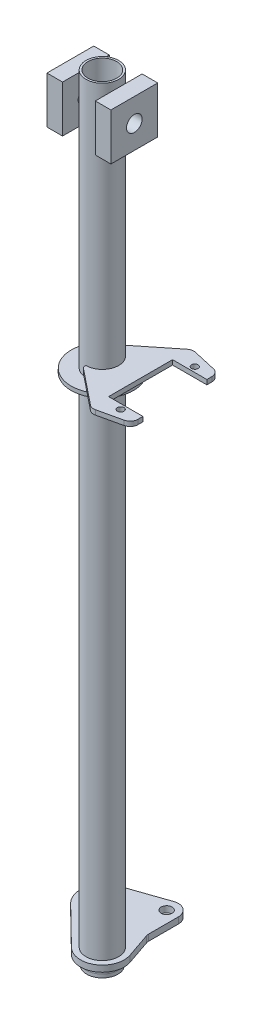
ISO-10303-21;
HEADER;
FILE_DESCRIPTION(('STEP AP214'),'2;1');
FILE_NAME('part.step','',(''),(''),'','','');
FILE_SCHEMA(('AUTOMOTIVE_DESIGN { 1 0 10303 214 1 1 1 1 }'));
ENDSEC;
DATA;
#1=APPLICATION_CONTEXT('core data for automotive mechanical design processes');
#2=APPLICATION_PROTOCOL_DEFINITION('international standard','automotive_design',2000,#1);
#3=PRODUCT_CONTEXT('',#1,'mechanical');
#4=PRODUCT('Part','Part','',(#3));
#5=PRODUCT_RELATED_PRODUCT_CATEGORY('part','',(#4));
#6=PRODUCT_DEFINITION_FORMATION('','',#4);
#7=PRODUCT_DEFINITION_CONTEXT('part definition',#1,'design');
#8=PRODUCT_DEFINITION('design','',#6,#7);
#9=PRODUCT_DEFINITION_SHAPE('','',#8);
#10=(LENGTH_UNIT() NAMED_UNIT(*) SI_UNIT(.MILLI.,.METRE.));
#11=(NAMED_UNIT(*) PLANE_ANGLE_UNIT() SI_UNIT($,.RADIAN.));
#12=(NAMED_UNIT(*) SI_UNIT($,.STERADIAN.) SOLID_ANGLE_UNIT());
#13=UNCERTAINTY_MEASURE_WITH_UNIT(LENGTH_MEASURE(1.E-05),#10,'distance_accuracy_value','');
#14=(GEOMETRIC_REPRESENTATION_CONTEXT(3) GLOBAL_UNCERTAINTY_ASSIGNED_CONTEXT((#13)) GLOBAL_UNIT_ASSIGNED_CONTEXT((#10,
#11,#12)) REPRESENTATION_CONTEXT('',''));
#15=CARTESIAN_POINT('',(0.,0.,0.));
#16=DIRECTION('',(0.,0.,1.));
#17=DIRECTION('',(1.,0.,0.));
#18=AXIS2_PLACEMENT_3D('',#15,#16,#17);
#19=CARTESIAN_POINT('',(-21.,973.,-30.));
#20=DIRECTION('',(-1.,0.,0.));
#21=DIRECTION('',(0.,0.,1.));
#22=AXIS2_PLACEMENT_3D('',#19,#20,#21);
#23=PLANE('',#22);
#24=CARTESIAN_POINT('',(-21.,943.,0.));
#25=DIRECTION('',(-1.,0.,0.));
#26=DIRECTION('',(0.,0.,1.));
#27=AXIS2_PLACEMENT_3D('',#24,#25,#26);
#28=CIRCLE('',#27,10.);
#29=CARTESIAN_POINT('',(-21.,943.,10.));
#30=VERTEX_POINT('',#29);
#31=EDGE_CURVE('E111',#30,#30,#28,.T.);
#32=ORIENTED_EDGE('',*,*,#31,.T.);
#33=EDGE_LOOP('',(#32));
#34=FACE_BOUND('',#33,.T.);
#35=DIRECTION('',(0.,-1.,0.));
#36=VECTOR('',#35,1.);
#37=CARTESIAN_POINT('',(-21.,973.,30.));
#38=LINE('',#37,#36);
#39=CARTESIAN_POINT('',(-21.,973.,30.));
#40=VERTEX_POINT('',#39);
#41=CARTESIAN_POINT('',(-21.,913.,30.));
#42=VERTEX_POINT('',#41);
#43=EDGE_CURVE('E98',#40,#42,#38,.T.);
#44=ORIENTED_EDGE('',*,*,#43,.T.);
#45=DIRECTION('',(0.,0.,1.));
#46=VECTOR('',#45,1.);
#47=CARTESIAN_POINT('',(-21.,913.,-30.));
#48=LINE('',#47,#46);
#49=CARTESIAN_POINT('',(-21.,913.,-30.));
#50=VERTEX_POINT('',#49);
#51=EDGE_CURVE('E12',#50,#42,#48,.T.);
#52=ORIENTED_EDGE('',*,*,#51,.F.);
#53=DIRECTION('',(0.,-1.,0.));
#54=VECTOR('',#53,1.);
#55=CARTESIAN_POINT('',(-21.,973.,-30.));
#56=LINE('',#55,#54);
#57=CARTESIAN_POINT('',(-21.,973.,-30.));
#58=VERTEX_POINT('',#57);
#59=EDGE_CURVE('E119',#58,#50,#56,.T.);
#60=ORIENTED_EDGE('',*,*,#59,.F.);
#61=DIRECTION('',(0.,0.,1.));
#62=VECTOR('',#61,1.);
#63=CARTESIAN_POINT('',(-21.,973.,-30.));
#64=LINE('',#63,#62);
#65=EDGE_CURVE('E110',#58,#40,#64,.T.);
#66=ORIENTED_EDGE('',*,*,#65,.T.);
#67=EDGE_LOOP('',(#44,#52,#60,#66));
#68=FACE_BOUND('',#67,.T.);
#69=ADVANCED_FACE('F53',(#34,#68),#23,.F.);
#70=CARTESIAN_POINT('',(-21.,913.,-30.));
#71=DIRECTION('',(0.,1.,0.));
#72=DIRECTION('',(0.,0.,1.));
#73=AXIS2_PLACEMENT_3D('',#70,#71,#72);
#74=PLANE('',#73);
#75=DIRECTION('',(-1.,0.,0.));
#76=VECTOR('',#75,1.);
#77=CARTESIAN_POINT('',(-21.,913.,30.));
#78=LINE('',#77,#76);
#79=CARTESIAN_POINT('',(-41.,913.,30.));
#80=VERTEX_POINT('',#79);
#81=EDGE_CURVE('E94',#42,#80,#78,.T.);
#82=ORIENTED_EDGE('',*,*,#81,.T.);
#83=DIRECTION('',(0.,0.,1.));
#84=VECTOR('',#83,1.);
#85=CARTESIAN_POINT('',(-41.,913.,-30.));
#86=LINE('',#85,#84);
#87=CARTESIAN_POINT('',(-41.,913.,-30.));
#88=VERTEX_POINT('',#87);
#89=EDGE_CURVE('E61',#88,#80,#86,.T.);
#90=ORIENTED_EDGE('',*,*,#89,.F.);
#91=DIRECTION('',(-1.,0.,0.));
#92=VECTOR('',#91,1.);
#93=CARTESIAN_POINT('',(-21.,913.,-30.));
#94=LINE('',#93,#92);
#95=EDGE_CURVE('E106',#50,#88,#94,.T.);
#96=ORIENTED_EDGE('',*,*,#95,.F.);
#97=ORIENTED_EDGE('',*,*,#51,.T.);
#98=EDGE_LOOP('',(#82,#90,#96,#97));
#99=FACE_BOUND('',#98,.T.);
#100=ADVANCED_FACE('F105',(#99),#74,.F.);
#101=CARTESIAN_POINT('',(-41.,973.,-30.));
#102=DIRECTION('',(1.,0.,0.));
#103=DIRECTION('',(0.,0.,-1.));
#104=AXIS2_PLACEMENT_3D('',#101,#102,#103);
#105=PLANE('',#104);
#106=CARTESIAN_POINT('',(-41.,943.,0.));
#107=DIRECTION('',(1.,0.,0.));
#108=DIRECTION('',(0.,0.,-1.));
#109=AXIS2_PLACEMENT_3D('',#106,#107,#108);
#110=CIRCLE('',#109,10.);
#111=CARTESIAN_POINT('',(-41.,943.,-10.));
#112=VERTEX_POINT('',#111);
#113=EDGE_CURVE('E56',#112,#112,#110,.T.);
#114=ORIENTED_EDGE('',*,*,#113,.T.);
#115=EDGE_LOOP('',(#114));
#116=FACE_BOUND('',#115,.T.);
#117=DIRECTION('',(0.,1.,0.));
#118=VECTOR('',#117,1.);
#119=CARTESIAN_POINT('',(-41.,973.,30.));
#120=LINE('',#119,#118);
#121=CARTESIAN_POINT('',(-41.,973.,30.));
#122=VERTEX_POINT('',#121);
#123=EDGE_CURVE('E99',#80,#122,#120,.T.);
#124=ORIENTED_EDGE('',*,*,#123,.T.);
#125=DIRECTION('',(0.,0.,1.));
#126=VECTOR('',#125,1.);
#127=CARTESIAN_POINT('',(-41.,973.,-30.));
#128=LINE('',#127,#126);
#129=CARTESIAN_POINT('',(-41.,973.,-30.));
#130=VERTEX_POINT('',#129);
#131=EDGE_CURVE('E125',#130,#122,#128,.T.);
#132=ORIENTED_EDGE('',*,*,#131,.F.);
#133=DIRECTION('',(0.,1.,0.));
#134=VECTOR('',#133,1.);
#135=CARTESIAN_POINT('',(-41.,973.,-30.));
#136=LINE('',#135,#134);
#137=EDGE_CURVE('E73',#88,#130,#136,.T.);
#138=ORIENTED_EDGE('',*,*,#137,.F.);
#139=ORIENTED_EDGE('',*,*,#89,.T.);
#140=EDGE_LOOP('',(#124,#132,#138,#139));
#141=FACE_BOUND('',#140,.T.);
#142=ADVANCED_FACE('F129',(#116,#141),#105,.F.);
#143=CARTESIAN_POINT('',(-21.,973.,-30.));
#144=DIRECTION('',(0.,-1.,0.));
#145=DIRECTION('',(0.,0.,-1.));
#146=AXIS2_PLACEMENT_3D('',#143,#144,#145);
#147=PLANE('',#146);
#148=DIRECTION('',(1.,0.,0.));
#149=VECTOR('',#148,1.);
#150=CARTESIAN_POINT('',(-21.,973.,30.));
#151=LINE('',#150,#149);
#152=EDGE_CURVE('E117',#122,#40,#151,.T.);
#153=ORIENTED_EDGE('',*,*,#152,.T.);
#154=ORIENTED_EDGE('',*,*,#65,.F.);
#155=DIRECTION('',(1.,0.,0.));
#156=VECTOR('',#155,1.);
#157=CARTESIAN_POINT('',(-21.,973.,-30.));
#158=LINE('',#157,#156);
#159=EDGE_CURVE('E68',#130,#58,#158,.T.);
#160=ORIENTED_EDGE('',*,*,#159,.F.);
#161=ORIENTED_EDGE('',*,*,#131,.T.);
#162=EDGE_LOOP('',(#153,#154,#160,#161));
#163=FACE_BOUND('',#162,.T.);
#164=ADVANCED_FACE('F131',(#163),#147,.F.);
#165=CARTESIAN_POINT('',(-21.,913.,-30.));
#166=DIRECTION('',(0.,0.,-1.));
#167=DIRECTION('',(-1.,0.,0.));
#168=AXIS2_PLACEMENT_3D('',#165,#166,#167);
#169=PLANE('',#168);
#170=ORIENTED_EDGE('',*,*,#59,.T.);
#171=ORIENTED_EDGE('',*,*,#95,.T.);
#172=ORIENTED_EDGE('',*,*,#137,.T.);
#173=ORIENTED_EDGE('',*,*,#159,.T.);
#174=EDGE_LOOP('',(#170,#171,#172,#173));
#175=FACE_BOUND('',#174,.T.);
#176=ADVANCED_FACE('F132',(#175),#169,.T.);
#177=CARTESIAN_POINT('',(-21.,913.,30.));
#178=DIRECTION('',(0.,0.,-1.));
#179=DIRECTION('',(-1.,0.,0.));
#180=AXIS2_PLACEMENT_3D('',#177,#178,#179);
#181=PLANE('',#180);
#182=ORIENTED_EDGE('',*,*,#43,.F.);
#183=ORIENTED_EDGE('',*,*,#152,.F.);
#184=ORIENTED_EDGE('',*,*,#123,.F.);
#185=ORIENTED_EDGE('',*,*,#81,.F.);
#186=EDGE_LOOP('',(#182,#183,#184,#185));
#187=FACE_BOUND('',#186,.T.);
#188=ADVANCED_FACE('F95',(#187),#181,.F.);
#189=CARTESIAN_POINT('',(-78.1,943.,0.));
#190=DIRECTION('',(1.,0.,0.));
#191=DIRECTION('',(0.,0.,-1.));
#192=AXIS2_PLACEMENT_3D('',#189,#190,#191);
#193=CYLINDRICAL_SURFACE('',#192,10.);
#194=ORIENTED_EDGE('',*,*,#113,.F.);
#195=EDGE_LOOP('',(#194));
#196=FACE_BOUND('',#195,.T.);
#197=ORIENTED_EDGE('',*,*,#31,.F.);
#198=EDGE_LOOP('',(#197));
#199=FACE_BOUND('',#198,.T.);
#200=ADVANCED_FACE('F139',(#196,#199),#193,.F.);
#201=CLOSED_SHELL('',(#69,#100,#142,#164,#176,#188,#200));
#202=MANIFOLD_SOLID_BREP('B2',#201);
#203=CARTESIAN_POINT('',(41.,973.,-30.));
#204=DIRECTION('',(-1.,0.,0.));
#205=DIRECTION('',(0.,0.,1.));
#206=AXIS2_PLACEMENT_3D('',#203,#204,#205);
#207=PLANE('',#206);
#208=CARTESIAN_POINT('',(41.,943.,0.));
#209=DIRECTION('',(-1.,0.,0.));
#210=DIRECTION('',(0.,0.,1.));
#211=AXIS2_PLACEMENT_3D('',#208,#209,#210);
#212=CIRCLE('',#211,10.);
#213=CARTESIAN_POINT('',(41.,943.,10.));
#214=VERTEX_POINT('',#213);
#215=EDGE_CURVE('E275',#214,#214,#212,.T.);
#216=ORIENTED_EDGE('',*,*,#215,.T.);
#217=EDGE_LOOP('',(#216));
#218=FACE_BOUND('',#217,.T.);
#219=DIRECTION('',(0.,-1.,0.));
#220=VECTOR('',#219,1.);
#221=CARTESIAN_POINT('',(41.,973.,30.));
#222=LINE('',#221,#220);
#223=CARTESIAN_POINT('',(41.,973.,30.));
#224=VERTEX_POINT('',#223);
#225=CARTESIAN_POINT('',(41.,913.,30.));
#226=VERTEX_POINT('',#225);
#227=EDGE_CURVE('E262',#224,#226,#222,.T.);
#228=ORIENTED_EDGE('',*,*,#227,.T.);
#229=DIRECTION('',(0.,0.,1.));
#230=VECTOR('',#229,1.);
#231=CARTESIAN_POINT('',(41.,913.,-30.));
#232=LINE('',#231,#230);
#233=CARTESIAN_POINT('',(41.,913.,-30.));
#234=VERTEX_POINT('',#233);
#235=EDGE_CURVE('E51',#234,#226,#232,.T.);
#236=ORIENTED_EDGE('',*,*,#235,.F.);
#237=DIRECTION('',(0.,-1.,0.));
#238=VECTOR('',#237,1.);
#239=CARTESIAN_POINT('',(41.,973.,-30.));
#240=LINE('',#239,#238);
#241=CARTESIAN_POINT('',(41.,973.,-30.));
#242=VERTEX_POINT('',#241);
#243=EDGE_CURVE('E283',#242,#234,#240,.T.);
#244=ORIENTED_EDGE('',*,*,#243,.F.);
#245=DIRECTION('',(0.,0.,1.));
#246=VECTOR('',#245,1.);
#247=CARTESIAN_POINT('',(41.,973.,-30.));
#248=LINE('',#247,#246);
#249=EDGE_CURVE('E274',#242,#224,#248,.T.);
#250=ORIENTED_EDGE('',*,*,#249,.T.);
#251=EDGE_LOOP('',(#228,#236,#244,#250));
#252=FACE_BOUND('',#251,.T.);
#253=ADVANCED_FACE('F217',(#218,#252),#207,.F.);
#254=CARTESIAN_POINT('',(41.,913.,-30.));
#255=DIRECTION('',(0.,1.,0.));
#256=DIRECTION('',(0.,0.,1.));
#257=AXIS2_PLACEMENT_3D('',#254,#255,#256);
#258=PLANE('',#257);
#259=DIRECTION('',(-1.,0.,0.));
#260=VECTOR('',#259,1.);
#261=CARTESIAN_POINT('',(41.,913.,30.));
#262=LINE('',#261,#260);
#263=CARTESIAN_POINT('',(21.,913.,30.));
#264=VERTEX_POINT('',#263);
#265=EDGE_CURVE('E258',#226,#264,#262,.T.);
#266=ORIENTED_EDGE('',*,*,#265,.T.);
#267=DIRECTION('',(0.,0.,1.));
#268=VECTOR('',#267,1.);
#269=CARTESIAN_POINT('',(21.,913.,-30.));
#270=LINE('',#269,#268);
#271=CARTESIAN_POINT('',(21.,913.,-30.));
#272=VERTEX_POINT('',#271);
#273=EDGE_CURVE('E225',#272,#264,#270,.T.);
#274=ORIENTED_EDGE('',*,*,#273,.F.);
#275=DIRECTION('',(-1.,0.,0.));
#276=VECTOR('',#275,1.);
#277=CARTESIAN_POINT('',(41.,913.,-30.));
#278=LINE('',#277,#276);
#279=EDGE_CURVE('E270',#234,#272,#278,.T.);
#280=ORIENTED_EDGE('',*,*,#279,.F.);
#281=ORIENTED_EDGE('',*,*,#235,.T.);
#282=EDGE_LOOP('',(#266,#274,#280,#281));
#283=FACE_BOUND('',#282,.T.);
#284=ADVANCED_FACE('F269',(#283),#258,.F.);
#285=CARTESIAN_POINT('',(21.,973.,-30.));
#286=DIRECTION('',(1.,0.,0.));
#287=DIRECTION('',(0.,0.,-1.));
#288=AXIS2_PLACEMENT_3D('',#285,#286,#287);
#289=PLANE('',#288);
#290=CARTESIAN_POINT('',(21.,943.,0.));
#291=DIRECTION('',(1.,0.,0.));
#292=DIRECTION('',(0.,0.,-1.));
#293=AXIS2_PLACEMENT_3D('',#290,#291,#292);
#294=CIRCLE('',#293,10.);
#295=CARTESIAN_POINT('',(21.,943.,-10.));
#296=VERTEX_POINT('',#295);
#297=EDGE_CURVE('E220',#296,#296,#294,.T.);
#298=ORIENTED_EDGE('',*,*,#297,.T.);
#299=EDGE_LOOP('',(#298));
#300=FACE_BOUND('',#299,.T.);
#301=DIRECTION('',(0.,1.,0.));
#302=VECTOR('',#301,1.);
#303=CARTESIAN_POINT('',(21.,973.,30.));
#304=LINE('',#303,#302);
#305=CARTESIAN_POINT('',(21.,973.,30.));
#306=VERTEX_POINT('',#305);
#307=EDGE_CURVE('E263',#264,#306,#304,.T.);
#308=ORIENTED_EDGE('',*,*,#307,.T.);
#309=DIRECTION('',(0.,0.,1.));
#310=VECTOR('',#309,1.);
#311=CARTESIAN_POINT('',(21.,973.,-30.));
#312=LINE('',#311,#310);
#313=CARTESIAN_POINT('',(21.,973.,-30.));
#314=VERTEX_POINT('',#313);
#315=EDGE_CURVE('E289',#314,#306,#312,.T.);
#316=ORIENTED_EDGE('',*,*,#315,.F.);
#317=DIRECTION('',(0.,1.,0.));
#318=VECTOR('',#317,1.);
#319=CARTESIAN_POINT('',(21.,973.,-30.));
#320=LINE('',#319,#318);
#321=EDGE_CURVE('E237',#272,#314,#320,.T.);
#322=ORIENTED_EDGE('',*,*,#321,.F.);
#323=ORIENTED_EDGE('',*,*,#273,.T.);
#324=EDGE_LOOP('',(#308,#316,#322,#323));
#325=FACE_BOUND('',#324,.T.);
#326=ADVANCED_FACE('F293',(#300,#325),#289,.F.);
#327=CARTESIAN_POINT('',(41.,973.,-30.));
#328=DIRECTION('',(0.,-1.,0.));
#329=DIRECTION('',(0.,0.,-1.));
#330=AXIS2_PLACEMENT_3D('',#327,#328,#329);
#331=PLANE('',#330);
#332=DIRECTION('',(1.,0.,0.));
#333=VECTOR('',#332,1.);
#334=CARTESIAN_POINT('',(41.,973.,30.));
#335=LINE('',#334,#333);
#336=EDGE_CURVE('E281',#306,#224,#335,.T.);
#337=ORIENTED_EDGE('',*,*,#336,.T.);
#338=ORIENTED_EDGE('',*,*,#249,.F.);
#339=DIRECTION('',(1.,0.,0.));
#340=VECTOR('',#339,1.);
#341=CARTESIAN_POINT('',(41.,973.,-30.));
#342=LINE('',#341,#340);
#343=EDGE_CURVE('E232',#314,#242,#342,.T.);
#344=ORIENTED_EDGE('',*,*,#343,.F.);
#345=ORIENTED_EDGE('',*,*,#315,.T.);
#346=EDGE_LOOP('',(#337,#338,#344,#345));
#347=FACE_BOUND('',#346,.T.);
#348=ADVANCED_FACE('F295',(#347),#331,.F.);
#349=CARTESIAN_POINT('',(41.,913.,-30.));
#350=DIRECTION('',(0.,0.,-1.));
#351=DIRECTION('',(-1.,0.,0.));
#352=AXIS2_PLACEMENT_3D('',#349,#350,#351);
#353=PLANE('',#352);
#354=ORIENTED_EDGE('',*,*,#243,.T.);
#355=ORIENTED_EDGE('',*,*,#279,.T.);
#356=ORIENTED_EDGE('',*,*,#321,.T.);
#357=ORIENTED_EDGE('',*,*,#343,.T.);
#358=EDGE_LOOP('',(#354,#355,#356,#357));
#359=FACE_BOUND('',#358,.T.);
#360=ADVANCED_FACE('F296',(#359),#353,.T.);
#361=CARTESIAN_POINT('',(41.,913.,30.));
#362=DIRECTION('',(0.,0.,-1.));
#363=DIRECTION('',(-1.,0.,0.));
#364=AXIS2_PLACEMENT_3D('',#361,#362,#363);
#365=PLANE('',#364);
#366=ORIENTED_EDGE('',*,*,#227,.F.);
#367=ORIENTED_EDGE('',*,*,#336,.F.);
#368=ORIENTED_EDGE('',*,*,#307,.F.);
#369=ORIENTED_EDGE('',*,*,#265,.F.);
#370=EDGE_LOOP('',(#366,#367,#368,#369));
#371=FACE_BOUND('',#370,.T.);
#372=ADVANCED_FACE('F259',(#371),#365,.F.);
#373=CARTESIAN_POINT('',(-78.1,943.,0.));
#374=DIRECTION('',(1.,0.,0.));
#375=DIRECTION('',(0.,0.,-1.));
#376=AXIS2_PLACEMENT_3D('',#373,#374,#375);
#377=CYLINDRICAL_SURFACE('',#376,10.);
#378=ORIENTED_EDGE('',*,*,#297,.F.);
#379=EDGE_LOOP('',(#378));
#380=FACE_BOUND('',#379,.T.);
#381=ORIENTED_EDGE('',*,*,#215,.F.);
#382=EDGE_LOOP('',(#381));
#383=FACE_BOUND('',#382,.T.);
#384=ADVANCED_FACE('F303',(#380,#383),#377,.F.);
#385=CLOSED_SHELL('',(#253,#284,#326,#348,#360,#372,#384));
#386=MANIFOLD_SOLID_BREP('B6',#385);
#387=CARTESIAN_POINT('',(0.,-12.,0.));
#388=DIRECTION('',(0.,1.,0.));
#389=DIRECTION('',(0.,0.,1.));
#390=AXIS2_PLACEMENT_3D('',#387,#388,#389);
#391=CYLINDRICAL_SURFACE('',#390,20.);
#392=CARTESIAN_POINT('',(0.,-12.,0.));
#393=DIRECTION('',(0.,-1.,0.));
#394=DIRECTION('',(0.,0.,-1.));
#395=AXIS2_PLACEMENT_3D('',#392,#393,#394);
#396=CIRCLE('',#395,20.);
#397=CARTESIAN_POINT('',(0.,-12.,-20.));
#398=VERTEX_POINT('',#397);
#399=EDGE_CURVE('E216',#398,#398,#396,.T.);
#400=ORIENTED_EDGE('',*,*,#399,.F.);
#401=EDGE_LOOP('',(#400));
#402=FACE_BOUND('',#401,.T.);
#403=CARTESIAN_POINT('',(0.,-7.,0.));
#404=DIRECTION('',(0.,-1.,0.));
#405=DIRECTION('',(0.,0.,-1.));
#406=AXIS2_PLACEMENT_3D('',#403,#404,#405);
#407=CIRCLE('',#406,20.);
#408=CARTESIAN_POINT('',(0.,-7.,-20.));
#409=VERTEX_POINT('',#408);
#410=EDGE_CURVE('E389',#409,#409,#407,.T.);
#411=ORIENTED_EDGE('',*,*,#410,.T.);
#412=EDGE_LOOP('',(#411));
#413=FACE_BOUND('',#412,.T.);
#414=ADVANCED_FACE('F383',(#402,#413),#391,.T.);
#415=CARTESIAN_POINT('',(0.,-12.,0.));
#416=DIRECTION('',(0.,-1.,0.));
#417=DIRECTION('',(0.,0.,-1.));
#418=AXIS2_PLACEMENT_3D('',#415,#416,#417);
#419=PLANE('',#418);
#420=ORIENTED_EDGE('',*,*,#399,.T.);
#421=EDGE_LOOP('',(#420));
#422=FACE_BOUND('',#421,.T.);
#423=ADVANCED_FACE('F398',(#422),#419,.T.);
#424=CARTESIAN_POINT('',(0.,-7.,0.));
#425=DIRECTION('',(0.,-1.,0.));
#426=DIRECTION('',(0.,0.,-1.));
#427=AXIS2_PLACEMENT_3D('',#424,#425,#426);
#428=PLANE('',#427);
#429=ORIENTED_EDGE('',*,*,#410,.F.);
#430=EDGE_LOOP('',(#429));
#431=FACE_BOUND('',#430,.T.);
#432=ADVANCED_FACE('F396',(#431),#428,.F.);
#433=CLOSED_SHELL('',(#414,#423,#432));
#434=MANIFOLD_SOLID_BREP('B45',#433);
#435=CARTESIAN_POINT('',(83.,658.3,47.3732157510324));
#436=DIRECTION('',(0.,1.,0.));
#437=DIRECTION('',(-1.,0.,0.));
#438=AXIS2_PLACEMENT_3D('',#435,#436,#437);
#439=PLANE('',#438);
#440=CARTESIAN_POINT('',(71.,658.3,47.5));
#441=DIRECTION('',(0.,-1.,0.));
#442=DIRECTION('',(1.,0.,0.));
#443=AXIS2_PLACEMENT_3D('',#440,#441,#442);
#444=CIRCLE('',#443,4.2);
#445=CARTESIAN_POINT('',(75.2,658.3,47.5));
#446=VERTEX_POINT('',#445);
#447=EDGE_CURVE('E575',#446,#446,#444,.T.);
#448=ORIENTED_EDGE('',*,*,#447,.F.);
#449=EDGE_LOOP('',(#448));
#450=FACE_BOUND('',#449,.T.);
#451=DIRECTION('',(1.,0.,0.));
#452=VECTOR('',#451,1.);
#453=CARTESIAN_POINT('',(49.,658.3,41.));
#454=LINE('',#453,#452);
#455=CARTESIAN_POINT('',(49.,658.3,41.));
#456=VERTEX_POINT('',#455);
#457=CARTESIAN_POINT('',(93.,658.3,41.));
#458=VERTEX_POINT('',#457);
#459=EDGE_CURVE('E613',#456,#458,#454,.T.);
#460=ORIENTED_EDGE('',*,*,#459,.T.);
#461=DIRECTION('',(0.,0.,1.));
#462=VECTOR('',#461,1.);
#463=CARTESIAN_POINT('',(93.,658.3,41.));
#464=LINE('',#463,#462);
#465=CARTESIAN_POINT('',(93.,658.3,47.3732157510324));
#466=VERTEX_POINT('',#465);
#467=EDGE_CURVE('E570',#458,#466,#464,.T.);
#468=ORIENTED_EDGE('',*,*,#467,.T.);
#469=CARTESIAN_POINT('',(83.,658.3,47.3732157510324));
#470=DIRECTION('',(0.,-1.,0.));
#471=DIRECTION('',(-1.,0.,0.));
#472=AXIS2_PLACEMENT_3D('',#469,#470,#471);
#473=CIRCLE('',#472,10.);
#474=CARTESIAN_POINT('',(85.2154849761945,658.3,57.1247092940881));
#475=VERTEX_POINT('',#474);
#476=EDGE_CURVE('E616',#466,#475,#473,.T.);
#477=ORIENTED_EDGE('',*,*,#476,.T.);
#478=DIRECTION('',(-0.975149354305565,0.,0.221548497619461));
#479=VECTOR('',#478,1.);
#480=CARTESIAN_POINT('',(85.2154849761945,658.3,57.1247092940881));
#481=LINE('',#480,#479);
#482=CARTESIAN_POINT('',(55.2558255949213,658.3,63.9313769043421));
#483=VERTEX_POINT('',#482);
#484=EDGE_CURVE('E618',#475,#483,#481,.T.);
#485=ORIENTED_EDGE('',*,*,#484,.T.);
#486=CARTESIAN_POINT('',(53.0403406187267,658.3,54.1798833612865));
#487=DIRECTION('',(0.,-1.,0.));
#488=DIRECTION('',(-1.,0.,0.));
#489=AXIS2_PLACEMENT_3D('',#486,#487,#488);
#490=CIRCLE('',#489,10.);
#491=CARTESIAN_POINT('',(46.7879140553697,658.3,61.9841874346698));
#492=VERTEX_POINT('',#491);
#493=EDGE_CURVE('E620',#483,#492,#490,.T.);
#494=ORIENTED_EDGE('',*,*,#493,.T.);
#495=DIRECTION('',(-0.780430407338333,0.,-0.625242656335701));
#496=VECTOR('',#495,1.);
#497=CARTESIAN_POINT('',(46.7879140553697,658.3,61.9841874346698));
#498=LINE('',#497,#496);
#499=CARTESIAN_POINT('',(1.12427203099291,658.3,25.4007117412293));
#500=VERTEX_POINT('',#499);
#501=EDGE_CURVE('E622',#492,#500,#498,.T.);
#502=ORIENTED_EDGE('',*,*,#501,.T.);
#503=CARTESIAN_POINT('',(3.,658.3,23.0594205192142));
#504=DIRECTION('',(0.,-1.,0.));
#505=DIRECTION('',(1.,0.,0.));
#506=AXIS2_PLACEMENT_3D('',#503,#504,#505);
#507=CIRCLE('',#506,3.);
#508=CARTESIAN_POINT('',(0.,658.3,23.0594205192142));
#509=VERTEX_POINT('',#508);
#510=EDGE_CURVE('E624',#500,#509,#507,.T.);
#511=ORIENTED_EDGE('',*,*,#510,.T.);
#512=DIRECTION('',(0.,0.,-1.));
#513=VECTOR('',#512,1.);
#514=CARTESIAN_POINT('',(0.,658.3,23.0594205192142));
#515=LINE('',#514,#513);
#516=CARTESIAN_POINT('',(0.,658.3,21.));
#517=VERTEX_POINT('',#516);
#518=EDGE_CURVE('E626',#509,#517,#515,.T.);
#519=ORIENTED_EDGE('',*,*,#518,.T.);
#520=CARTESIAN_POINT('',(0.,658.3,0.));
#521=DIRECTION('',(0.,1.,0.));
#522=DIRECTION('',(-1.,0.,0.));
#523=AXIS2_PLACEMENT_3D('',#520,#521,#522);
#524=CIRCLE('',#523,21.);
#525=CARTESIAN_POINT('',(0.,658.3,-21.));
#526=VERTEX_POINT('',#525);
#527=EDGE_CURVE('E628',#517,#526,#524,.T.);
#528=ORIENTED_EDGE('',*,*,#527,.T.);
#529=DIRECTION('',(0.,0.,-1.));
#530=VECTOR('',#529,1.);
#531=CARTESIAN_POINT('',(0.,658.3,-23.0594205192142));
#532=LINE('',#531,#530);
#533=CARTESIAN_POINT('',(0.,658.3,-23.0594205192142));
#534=VERTEX_POINT('',#533);
#535=EDGE_CURVE('E630',#526,#534,#532,.T.);
#536=ORIENTED_EDGE('',*,*,#535,.T.);
#537=CARTESIAN_POINT('',(3.,658.3,-23.0594205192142));
#538=DIRECTION('',(0.,-1.,0.));
#539=DIRECTION('',(-1.,0.,0.));
#540=AXIS2_PLACEMENT_3D('',#537,#538,#539);
#541=CIRCLE('',#540,3.);
#542=CARTESIAN_POINT('',(1.12427203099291,658.3,-25.4007117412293));
#543=VERTEX_POINT('',#542);
#544=EDGE_CURVE('E632',#534,#543,#541,.T.);
#545=ORIENTED_EDGE('',*,*,#544,.T.);
#546=DIRECTION('',(0.780430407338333,0.,-0.625242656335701));
#547=VECTOR('',#546,1.);
#548=CARTESIAN_POINT('',(46.7879140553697,658.3,-61.9841874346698));
#549=LINE('',#548,#547);
#550=CARTESIAN_POINT('',(46.7879140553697,658.3,-61.9841874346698));
#551=VERTEX_POINT('',#550);
#552=EDGE_CURVE('E634',#543,#551,#549,.T.);
#553=ORIENTED_EDGE('',*,*,#552,.T.);
#554=CARTESIAN_POINT('',(53.0403406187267,658.3,-54.1798833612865));
#555=DIRECTION('',(0.,-1.,0.));
#556=DIRECTION('',(1.,0.,0.));
#557=AXIS2_PLACEMENT_3D('',#554,#555,#556);
#558=CIRCLE('',#557,10.);
#559=CARTESIAN_POINT('',(55.2558255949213,658.3,-63.9313769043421));
#560=VERTEX_POINT('',#559);
#561=EDGE_CURVE('E636',#551,#560,#558,.T.);
#562=ORIENTED_EDGE('',*,*,#561,.T.);
#563=DIRECTION('',(0.975149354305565,0.,0.221548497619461));
#564=VECTOR('',#563,1.);
#565=CARTESIAN_POINT('',(85.2154849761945,658.3,-57.1247092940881));
#566=LINE('',#565,#564);
#567=CARTESIAN_POINT('',(85.2154849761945,658.3,-57.1247092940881));
#568=VERTEX_POINT('',#567);
#569=EDGE_CURVE('E638',#560,#568,#566,.T.);
#570=ORIENTED_EDGE('',*,*,#569,.T.);
#571=CARTESIAN_POINT('',(83.,658.3,-47.3732157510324));
#572=DIRECTION('',(0.,-1.,0.));
#573=DIRECTION('',(1.,0.,0.));
#574=AXIS2_PLACEMENT_3D('',#571,#572,#573);
#575=CIRCLE('',#574,10.);
#576=CARTESIAN_POINT('',(93.,658.3,-47.3732157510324));
#577=VERTEX_POINT('',#576);
#578=EDGE_CURVE('E640',#568,#577,#575,.T.);
#579=ORIENTED_EDGE('',*,*,#578,.T.);
#580=DIRECTION('',(0.,0.,1.));
#581=VECTOR('',#580,1.);
#582=CARTESIAN_POINT('',(93.,658.3,-41.));
#583=LINE('',#582,#581);
#584=CARTESIAN_POINT('',(93.,658.3,-41.));
#585=VERTEX_POINT('',#584);
#586=EDGE_CURVE('E642',#577,#585,#583,.T.);
#587=ORIENTED_EDGE('',*,*,#586,.T.);
#588=DIRECTION('',(-1.,0.,0.));
#589=VECTOR('',#588,1.);
#590=CARTESIAN_POINT('',(49.,658.3,-41.));
#591=LINE('',#590,#589);
#592=CARTESIAN_POINT('',(49.,658.3,-41.));
#593=VERTEX_POINT('',#592);
#594=EDGE_CURVE('E451',#585,#593,#591,.T.);
#595=ORIENTED_EDGE('',*,*,#594,.T.);
#596=DIRECTION('',(0.,0.,1.));
#597=VECTOR('',#596,1.);
#598=CARTESIAN_POINT('',(49.,658.3,-41.));
#599=LINE('',#598,#597);
#600=EDGE_CURVE('E446',#593,#456,#599,.T.);
#601=ORIENTED_EDGE('',*,*,#600,.T.);
#602=EDGE_LOOP('',(#460,#468,#477,#485,#494,#502,#511,#519,#528,#536,#545,#553,#562,#570,#579,
#587,#595,#601));
#603=FACE_BOUND('',#602,.T.);
#604=CARTESIAN_POINT('',(71.,658.3,-47.5));
#605=DIRECTION('',(0.,-1.,0.));
#606=DIRECTION('',(-1.,0.,0.));
#607=AXIS2_PLACEMENT_3D('',#604,#605,#606);
#608=CIRCLE('',#607,4.2);
#609=CARTESIAN_POINT('',(66.8,658.3,-47.5));
#610=VERTEX_POINT('',#609);
#611=EDGE_CURVE('E793',#610,#610,#608,.T.);
#612=ORIENTED_EDGE('',*,*,#611,.F.);
#613=EDGE_LOOP('',(#612));
#614=FACE_BOUND('',#613,.T.);
#615=ADVANCED_FACE('F431',(#450,#603,#614),#439,.F.);
#616=CARTESIAN_POINT('',(83.,664.3,47.3732157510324));
#617=DIRECTION('',(0.,1.,0.));
#618=DIRECTION('',(-1.,0.,0.));
#619=AXIS2_PLACEMENT_3D('',#616,#617,#618);
#620=PLANE('',#619);
#621=CARTESIAN_POINT('',(71.,664.3,47.5));
#622=DIRECTION('',(0.,-1.,0.));
#623=DIRECTION('',(1.,0.,0.));
#624=AXIS2_PLACEMENT_3D('',#621,#622,#623);
#625=CIRCLE('',#624,4.2);
#626=CARTESIAN_POINT('',(75.2,664.3,47.5));
#627=VERTEX_POINT('',#626);
#628=EDGE_CURVE('E578',#627,#627,#625,.T.);
#629=ORIENTED_EDGE('',*,*,#628,.T.);
#630=EDGE_LOOP('',(#629));
#631=FACE_BOUND('',#630,.T.);
#632=DIRECTION('',(1.,0.,0.));
#633=VECTOR('',#632,1.);
#634=CARTESIAN_POINT('',(49.,664.3,41.));
#635=LINE('',#634,#633);
#636=CARTESIAN_POINT('',(49.,664.3,41.));
#637=VERTEX_POINT('',#636);
#638=CARTESIAN_POINT('',(93.,664.3,41.));
#639=VERTEX_POINT('',#638);
#640=EDGE_CURVE('E561',#637,#639,#635,.T.);
#641=ORIENTED_EDGE('',*,*,#640,.F.);
#642=DIRECTION('',(0.,0.,1.));
#643=VECTOR('',#642,1.);
#644=CARTESIAN_POINT('',(49.,664.3,-41.));
#645=LINE('',#644,#643);
#646=CARTESIAN_POINT('',(49.,664.3,-41.));
#647=VERTEX_POINT('',#646);
#648=EDGE_CURVE('E611',#647,#637,#645,.T.);
#649=ORIENTED_EDGE('',*,*,#648,.F.);
#650=DIRECTION('',(-1.,0.,0.));
#651=VECTOR('',#650,1.);
#652=CARTESIAN_POINT('',(49.,664.3,-41.));
#653=LINE('',#652,#651);
#654=CARTESIAN_POINT('',(93.,664.3,-41.));
#655=VERTEX_POINT('',#654);
#656=EDGE_CURVE('E609',#655,#647,#653,.T.);
#657=ORIENTED_EDGE('',*,*,#656,.F.);
#658=DIRECTION('',(0.,0.,1.));
#659=VECTOR('',#658,1.);
#660=CARTESIAN_POINT('',(93.,664.3,-41.));
#661=LINE('',#660,#659);
#662=CARTESIAN_POINT('',(93.,664.3,-47.3732157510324));
#663=VERTEX_POINT('',#662);
#664=EDGE_CURVE('E607',#663,#655,#661,.T.);
#665=ORIENTED_EDGE('',*,*,#664,.F.);
#666=CARTESIAN_POINT('',(83.,664.3,-47.3732157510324));
#667=DIRECTION('',(0.,-1.,0.));
#668=DIRECTION('',(1.,0.,0.));
#669=AXIS2_PLACEMENT_3D('',#666,#667,#668);
#670=CIRCLE('',#669,10.);
#671=CARTESIAN_POINT('',(85.2154849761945,664.3,-57.1247092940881));
#672=VERTEX_POINT('',#671);
#673=EDGE_CURVE('E605',#672,#663,#670,.T.);
#674=ORIENTED_EDGE('',*,*,#673,.F.);
#675=DIRECTION('',(0.975149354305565,0.,0.221548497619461));
#676=VECTOR('',#675,1.);
#677=CARTESIAN_POINT('',(85.2154849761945,664.3,-57.1247092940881));
#678=LINE('',#677,#676);
#679=CARTESIAN_POINT('',(55.2558255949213,664.3,-63.9313769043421));
#680=VERTEX_POINT('',#679);
#681=EDGE_CURVE('E603',#680,#672,#678,.T.);
#682=ORIENTED_EDGE('',*,*,#681,.F.);
#683=CARTESIAN_POINT('',(53.0403406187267,664.3,-54.1798833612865));
#684=DIRECTION('',(0.,-1.,0.));
#685=DIRECTION('',(1.,0.,0.));
#686=AXIS2_PLACEMENT_3D('',#683,#684,#685);
#687=CIRCLE('',#686,10.);
#688=CARTESIAN_POINT('',(46.7879140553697,664.3,-61.9841874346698));
#689=VERTEX_POINT('',#688);
#690=EDGE_CURVE('E601',#689,#680,#687,.T.);
#691=ORIENTED_EDGE('',*,*,#690,.F.);
#692=DIRECTION('',(0.780430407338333,0.,-0.625242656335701));
#693=VECTOR('',#692,1.);
#694=CARTESIAN_POINT('',(46.7879140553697,664.3,-61.9841874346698));
#695=LINE('',#694,#693);
#696=CARTESIAN_POINT('',(1.12427203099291,664.3,-25.4007117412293));
#697=VERTEX_POINT('',#696);
#698=EDGE_CURVE('E599',#697,#689,#695,.T.);
#699=ORIENTED_EDGE('',*,*,#698,.F.);
#700=CARTESIAN_POINT('',(3.,664.3,-23.0594205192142));
#701=DIRECTION('',(0.,-1.,0.));
#702=DIRECTION('',(-1.,0.,0.));
#703=AXIS2_PLACEMENT_3D('',#700,#701,#702);
#704=CIRCLE('',#703,3.);
#705=CARTESIAN_POINT('',(0.,664.3,-23.0594205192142));
#706=VERTEX_POINT('',#705);
#707=EDGE_CURVE('E597',#706,#697,#704,.T.);
#708=ORIENTED_EDGE('',*,*,#707,.F.);
#709=DIRECTION('',(0.,0.,-1.));
#710=VECTOR('',#709,1.);
#711=CARTESIAN_POINT('',(0.,664.3,-23.0594205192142));
#712=LINE('',#711,#710);
#713=CARTESIAN_POINT('',(0.,664.3,-21.));
#714=VERTEX_POINT('',#713);
#715=EDGE_CURVE('E595',#714,#706,#712,.T.);
#716=ORIENTED_EDGE('',*,*,#715,.F.);
#717=CARTESIAN_POINT('',(0.,664.3,0.));
#718=DIRECTION('',(0.,1.,0.));
#719=DIRECTION('',(-1.,0.,0.));
#720=AXIS2_PLACEMENT_3D('',#717,#718,#719);
#721=CIRCLE('',#720,21.);
#722=CARTESIAN_POINT('',(0.,664.3,21.));
#723=VERTEX_POINT('',#722);
#724=EDGE_CURVE('E593',#723,#714,#721,.T.);
#725=ORIENTED_EDGE('',*,*,#724,.F.);
#726=DIRECTION('',(0.,0.,-1.));
#727=VECTOR('',#726,1.);
#728=CARTESIAN_POINT('',(0.,664.3,23.0594205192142));
#729=LINE('',#728,#727);
#730=CARTESIAN_POINT('',(0.,664.3,23.0594205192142));
#731=VERTEX_POINT('',#730);
#732=EDGE_CURVE('E591',#731,#723,#729,.T.);
#733=ORIENTED_EDGE('',*,*,#732,.F.);
#734=CARTESIAN_POINT('',(3.,664.3,23.0594205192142));
#735=DIRECTION('',(0.,-1.,0.));
#736=DIRECTION('',(1.,0.,0.));
#737=AXIS2_PLACEMENT_3D('',#734,#735,#736);
#738=CIRCLE('',#737,3.);
#739=CARTESIAN_POINT('',(1.12427203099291,664.3,25.4007117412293));
#740=VERTEX_POINT('',#739);
#741=EDGE_CURVE('E589',#740,#731,#738,.T.);
#742=ORIENTED_EDGE('',*,*,#741,.F.);
#743=DIRECTION('',(-0.780430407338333,0.,-0.625242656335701));
#744=VECTOR('',#743,1.);
#745=CARTESIAN_POINT('',(46.7879140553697,664.3,61.9841874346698));
#746=LINE('',#745,#744);
#747=CARTESIAN_POINT('',(46.7879140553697,664.3,61.9841874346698));
#748=VERTEX_POINT('',#747);
#749=EDGE_CURVE('E587',#748,#740,#746,.T.);
#750=ORIENTED_EDGE('',*,*,#749,.F.);
#751=CARTESIAN_POINT('',(53.0403406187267,664.3,54.1798833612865));
#752=DIRECTION('',(0.,-1.,0.));
#753=DIRECTION('',(-1.,0.,0.));
#754=AXIS2_PLACEMENT_3D('',#751,#752,#753);
#755=CIRCLE('',#754,10.);
#756=CARTESIAN_POINT('',(55.2558255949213,664.3,63.9313769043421));
#757=VERTEX_POINT('',#756);
#758=EDGE_CURVE('E585',#757,#748,#755,.T.);
#759=ORIENTED_EDGE('',*,*,#758,.F.);
#760=DIRECTION('',(-0.975149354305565,0.,0.221548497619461));
#761=VECTOR('',#760,1.);
#762=CARTESIAN_POINT('',(85.2154849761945,664.3,57.1247092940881));
#763=LINE('',#762,#761);
#764=CARTESIAN_POINT('',(85.2154849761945,664.3,57.1247092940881));
#765=VERTEX_POINT('',#764);
#766=EDGE_CURVE('E583',#765,#757,#763,.T.);
#767=ORIENTED_EDGE('',*,*,#766,.F.);
#768=CARTESIAN_POINT('',(83.,664.3,47.3732157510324));
#769=DIRECTION('',(0.,-1.,0.));
#770=DIRECTION('',(-1.,0.,0.));
#771=AXIS2_PLACEMENT_3D('',#768,#769,#770);
#772=CIRCLE('',#771,10.);
#773=CARTESIAN_POINT('',(93.,664.3,47.3732157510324));
#774=VERTEX_POINT('',#773);
#775=EDGE_CURVE('E563',#774,#765,#772,.T.);
#776=ORIENTED_EDGE('',*,*,#775,.F.);
#777=DIRECTION('',(0.,0.,1.));
#778=VECTOR('',#777,1.);
#779=CARTESIAN_POINT('',(93.,664.3,41.));
#780=LINE('',#779,#778);
#781=EDGE_CURVE('E556',#639,#774,#780,.T.);
#782=ORIENTED_EDGE('',*,*,#781,.F.);
#783=EDGE_LOOP('',(#641,#649,#657,#665,#674,#682,#691,#699,#708,#716,#725,#733,#742,#750,#759,
#767,#776,#782));
#784=FACE_BOUND('',#783,.T.);
#785=CARTESIAN_POINT('',(71.,664.3,-47.5));
#786=DIRECTION('',(0.,-1.,0.));
#787=DIRECTION('',(-1.,0.,0.));
#788=AXIS2_PLACEMENT_3D('',#785,#786,#787);
#789=CIRCLE('',#788,4.2);
#790=CARTESIAN_POINT('',(66.8,664.3,-47.5));
#791=VERTEX_POINT('',#790);
#792=EDGE_CURVE('E796',#791,#791,#789,.T.);
#793=ORIENTED_EDGE('',*,*,#792,.T.);
#794=EDGE_LOOP('',(#793));
#795=FACE_BOUND('',#794,.T.);
#796=ADVANCED_FACE('F557',(#631,#784,#795),#620,.T.);
#797=CARTESIAN_POINT('',(49.,658.3,41.));
#798=DIRECTION('',(0.,0.,1.));
#799=DIRECTION('',(-1.,0.,0.));
#800=AXIS2_PLACEMENT_3D('',#797,#798,#799);
#801=PLANE('',#800);
#802=ORIENTED_EDGE('',*,*,#640,.T.);
#803=DIRECTION('',(0.,1.,0.));
#804=VECTOR('',#803,1.);
#805=CARTESIAN_POINT('',(93.,658.3,41.));
#806=LINE('',#805,#804);
#807=EDGE_CURVE('E381',#458,#639,#806,.T.);
#808=ORIENTED_EDGE('',*,*,#807,.F.);
#809=ORIENTED_EDGE('',*,*,#459,.F.);
#810=DIRECTION('',(0.,1.,0.));
#811=VECTOR('',#810,1.);
#812=CARTESIAN_POINT('',(49.,658.3,41.));
#813=LINE('',#812,#811);
#814=EDGE_CURVE('E574',#456,#637,#813,.T.);
#815=ORIENTED_EDGE('',*,*,#814,.T.);
#816=EDGE_LOOP('',(#802,#808,#809,#815));
#817=FACE_BOUND('',#816,.T.);
#818=ADVANCED_FACE('F433',(#817),#801,.F.);
#819=CARTESIAN_POINT('',(93.,658.3,41.));
#820=DIRECTION('',(-1.,0.,0.));
#821=DIRECTION('',(0.,-1.,0.));
#822=AXIS2_PLACEMENT_3D('',#819,#820,#821);
#823=PLANE('',#822);
#824=ORIENTED_EDGE('',*,*,#781,.T.);
#825=DIRECTION('',(0.,1.,0.));
#826=VECTOR('',#825,1.);
#827=CARTESIAN_POINT('',(93.,658.3,47.3732157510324));
#828=LINE('',#827,#826);
#829=EDGE_CURVE('E439',#466,#774,#828,.T.);
#830=ORIENTED_EDGE('',*,*,#829,.F.);
#831=ORIENTED_EDGE('',*,*,#467,.F.);
#832=ORIENTED_EDGE('',*,*,#807,.T.);
#833=EDGE_LOOP('',(#824,#830,#831,#832));
#834=FACE_BOUND('',#833,.T.);
#835=ADVANCED_FACE('F569',(#834),#823,.F.);
#836=CARTESIAN_POINT('',(83.,658.3,47.3732157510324));
#837=DIRECTION('',(0.,1.,0.));
#838=DIRECTION('',(-1.,0.,0.));
#839=AXIS2_PLACEMENT_3D('',#836,#837,#838);
#840=CYLINDRICAL_SURFACE('',#839,10.);
#841=ORIENTED_EDGE('',*,*,#775,.T.);
#842=DIRECTION('',(0.,1.,0.));
#843=VECTOR('',#842,1.);
#844=CARTESIAN_POINT('',(85.2154849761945,658.3,57.1247092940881));
#845=LINE('',#844,#843);
#846=EDGE_CURVE('E689',#475,#765,#845,.T.);
#847=ORIENTED_EDGE('',*,*,#846,.F.);
#848=ORIENTED_EDGE('',*,*,#476,.F.);
#849=ORIENTED_EDGE('',*,*,#829,.T.);
#850=EDGE_LOOP('',(#841,#847,#848,#849));
#851=FACE_BOUND('',#850,.T.);
#852=ADVANCED_FACE('F693',(#851),#840,.T.);
#853=CARTESIAN_POINT('',(85.2154849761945,658.3,57.1247092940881));
#854=DIRECTION('',(-0.221548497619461,0.,-0.975149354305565));
#855=DIRECTION('',(0.975149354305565,0.,-0.221548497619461));
#856=AXIS2_PLACEMENT_3D('',#853,#854,#855);
#857=PLANE('',#856);
#858=ORIENTED_EDGE('',*,*,#766,.T.);
#859=DIRECTION('',(0.,1.,0.));
#860=VECTOR('',#859,1.);
#861=CARTESIAN_POINT('',(55.2558255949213,658.3,63.9313769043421));
#862=LINE('',#861,#860);
#863=EDGE_CURVE('E686',#483,#757,#862,.T.);
#864=ORIENTED_EDGE('',*,*,#863,.F.);
#865=ORIENTED_EDGE('',*,*,#484,.F.);
#866=ORIENTED_EDGE('',*,*,#846,.T.);
#867=EDGE_LOOP('',(#858,#864,#865,#866));
#868=FACE_BOUND('',#867,.T.);
#869=ADVANCED_FACE('F701',(#868),#857,.F.);
#870=CARTESIAN_POINT('',(53.0403406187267,658.3,54.1798833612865));
#871=DIRECTION('',(0.,1.,0.));
#872=DIRECTION('',(-1.,0.,0.));
#873=AXIS2_PLACEMENT_3D('',#870,#871,#872);
#874=CYLINDRICAL_SURFACE('',#873,10.);
#875=ORIENTED_EDGE('',*,*,#758,.T.);
#876=DIRECTION('',(0.,1.,0.));
#877=VECTOR('',#876,1.);
#878=CARTESIAN_POINT('',(46.7879140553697,658.3,61.9841874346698));
#879=LINE('',#878,#877);
#880=EDGE_CURVE('E683',#492,#748,#879,.T.);
#881=ORIENTED_EDGE('',*,*,#880,.F.);
#882=ORIENTED_EDGE('',*,*,#493,.F.);
#883=ORIENTED_EDGE('',*,*,#863,.T.);
#884=EDGE_LOOP('',(#875,#881,#882,#883));
#885=FACE_BOUND('',#884,.T.);
#886=ADVANCED_FACE('F704',(#885),#874,.T.);
#887=CARTESIAN_POINT('',(46.7879140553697,658.3,61.9841874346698));
#888=DIRECTION('',(0.625242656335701,0.,-0.780430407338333));
#889=DIRECTION('',(0.780430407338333,0.,0.625242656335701));
#890=AXIS2_PLACEMENT_3D('',#887,#888,#889);
#891=PLANE('',#890);
#892=ORIENTED_EDGE('',*,*,#749,.T.);
#893=DIRECTION('',(0.,1.,0.));
#894=VECTOR('',#893,1.);
#895=CARTESIAN_POINT('',(1.12427203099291,658.3,25.4007117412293));
#896=LINE('',#895,#894);
#897=EDGE_CURVE('E680',#500,#740,#896,.T.);
#898=ORIENTED_EDGE('',*,*,#897,.F.);
#899=ORIENTED_EDGE('',*,*,#501,.F.);
#900=ORIENTED_EDGE('',*,*,#880,.T.);
#901=EDGE_LOOP('',(#892,#898,#899,#900));
#902=FACE_BOUND('',#901,.T.);
#903=ADVANCED_FACE('F709',(#902),#891,.F.);
#904=CARTESIAN_POINT('',(3.,658.3,23.0594205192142));
#905=DIRECTION('',(0.,1.,0.));
#906=DIRECTION('',(-1.,0.,0.));
#907=AXIS2_PLACEMENT_3D('',#904,#905,#906);
#908=CYLINDRICAL_SURFACE('',#907,3.);
#909=ORIENTED_EDGE('',*,*,#741,.T.);
#910=DIRECTION('',(0.,1.,0.));
#911=VECTOR('',#910,1.);
#912=CARTESIAN_POINT('',(0.,658.3,23.0594205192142));
#913=LINE('',#912,#911);
#914=EDGE_CURVE('E677',#509,#731,#913,.T.);
#915=ORIENTED_EDGE('',*,*,#914,.F.);
#916=ORIENTED_EDGE('',*,*,#510,.F.);
#917=ORIENTED_EDGE('',*,*,#897,.T.);
#918=EDGE_LOOP('',(#909,#915,#916,#917));
#919=FACE_BOUND('',#918,.T.);
#920=ADVANCED_FACE('F715',(#919),#908,.T.);
#921=CARTESIAN_POINT('',(0.,658.3,23.0594205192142));
#922=DIRECTION('',(1.,0.,0.));
#923=DIRECTION('',(0.,0.,1.));
#924=AXIS2_PLACEMENT_3D('',#921,#922,#923);
#925=PLANE('',#924);
#926=ORIENTED_EDGE('',*,*,#732,.T.);
#927=DIRECTION('',(0.,1.,0.));
#928=VECTOR('',#927,1.);
#929=CARTESIAN_POINT('',(0.,658.3,21.));
#930=LINE('',#929,#928);
#931=EDGE_CURVE('E674',#517,#723,#930,.T.);
#932=ORIENTED_EDGE('',*,*,#931,.F.);
#933=ORIENTED_EDGE('',*,*,#518,.F.);
#934=ORIENTED_EDGE('',*,*,#914,.T.);
#935=EDGE_LOOP('',(#926,#932,#933,#934));
#936=FACE_BOUND('',#935,.T.);
#937=ADVANCED_FACE('F719',(#936),#925,.F.);
#938=CARTESIAN_POINT('',(0.,658.3,0.));
#939=DIRECTION('',(0.,1.,0.));
#940=DIRECTION('',(-1.,0.,0.));
#941=AXIS2_PLACEMENT_3D('',#938,#939,#940);
#942=CYLINDRICAL_SURFACE('',#941,21.);
#943=ORIENTED_EDGE('',*,*,#724,.T.);
#944=DIRECTION('',(0.,1.,0.));
#945=VECTOR('',#944,1.);
#946=CARTESIAN_POINT('',(0.,658.3,-21.));
#947=LINE('',#946,#945);
#948=EDGE_CURVE('E671',#526,#714,#947,.T.);
#949=ORIENTED_EDGE('',*,*,#948,.F.);
#950=ORIENTED_EDGE('',*,*,#527,.F.);
#951=ORIENTED_EDGE('',*,*,#931,.T.);
#952=EDGE_LOOP('',(#943,#949,#950,#951));
#953=FACE_BOUND('',#952,.T.);
#954=ADVANCED_FACE('F724',(#953),#942,.F.);
#955=CARTESIAN_POINT('',(0.,658.3,-23.0594205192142));
#956=DIRECTION('',(1.,0.,0.));
#957=DIRECTION('',(0.,0.,1.));
#958=AXIS2_PLACEMENT_3D('',#955,#956,#957);
#959=PLANE('',#958);
#960=ORIENTED_EDGE('',*,*,#715,.T.);
#961=DIRECTION('',(0.,1.,0.));
#962=VECTOR('',#961,1.);
#963=CARTESIAN_POINT('',(0.,658.3,-23.0594205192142));
#964=LINE('',#963,#962);
#965=EDGE_CURVE('E668',#534,#706,#964,.T.);
#966=ORIENTED_EDGE('',*,*,#965,.F.);
#967=ORIENTED_EDGE('',*,*,#535,.F.);
#968=ORIENTED_EDGE('',*,*,#948,.T.);
#969=EDGE_LOOP('',(#960,#966,#967,#968));
#970=FACE_BOUND('',#969,.T.);
#971=ADVANCED_FACE('F730',(#970),#959,.F.);
#972=CARTESIAN_POINT('',(3.,658.3,-23.0594205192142));
#973=DIRECTION('',(0.,1.,0.));
#974=DIRECTION('',(-1.,0.,0.));
#975=AXIS2_PLACEMENT_3D('',#972,#973,#974);
#976=CYLINDRICAL_SURFACE('',#975,3.);
#977=ORIENTED_EDGE('',*,*,#707,.T.);
#978=DIRECTION('',(0.,1.,0.));
#979=VECTOR('',#978,1.);
#980=CARTESIAN_POINT('',(1.12427203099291,658.3,-25.4007117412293));
#981=LINE('',#980,#979);
#982=EDGE_CURVE('E665',#543,#697,#981,.T.);
#983=ORIENTED_EDGE('',*,*,#982,.F.);
#984=ORIENTED_EDGE('',*,*,#544,.F.);
#985=ORIENTED_EDGE('',*,*,#965,.T.);
#986=EDGE_LOOP('',(#977,#983,#984,#985));
#987=FACE_BOUND('',#986,.T.);
#988=ADVANCED_FACE('F734',(#987),#976,.T.);
#989=CARTESIAN_POINT('',(46.7879140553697,658.3,-61.9841874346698));
#990=DIRECTION('',(0.625242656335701,0.,0.780430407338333));
#991=DIRECTION('',(-0.780430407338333,0.,0.625242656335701));
#992=AXIS2_PLACEMENT_3D('',#989,#990,#991);
#993=PLANE('',#992);
#994=ORIENTED_EDGE('',*,*,#698,.T.);
#995=DIRECTION('',(0.,1.,0.));
#996=VECTOR('',#995,1.);
#997=CARTESIAN_POINT('',(46.7879140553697,658.3,-61.9841874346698));
#998=LINE('',#997,#996);
#999=EDGE_CURVE('E662',#551,#689,#998,.T.);
#1000=ORIENTED_EDGE('',*,*,#999,.F.);
#1001=ORIENTED_EDGE('',*,*,#552,.F.);
#1002=ORIENTED_EDGE('',*,*,#982,.T.);
#1003=EDGE_LOOP('',(#994,#1000,#1001,#1002));
#1004=FACE_BOUND('',#1003,.T.);
#1005=ADVANCED_FACE('F739',(#1004),#993,.F.);
#1006=CARTESIAN_POINT('',(53.0403406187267,658.3,-54.1798833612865));
#1007=DIRECTION('',(0.,1.,0.));
#1008=DIRECTION('',(-1.,0.,0.));
#1009=AXIS2_PLACEMENT_3D('',#1006,#1007,#1008);
#1010=CYLINDRICAL_SURFACE('',#1009,10.);
#1011=ORIENTED_EDGE('',*,*,#690,.T.);
#1012=DIRECTION('',(0.,1.,0.));
#1013=VECTOR('',#1012,1.);
#1014=CARTESIAN_POINT('',(55.2558255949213,658.3,-63.9313769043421));
#1015=LINE('',#1014,#1013);
#1016=EDGE_CURVE('E659',#560,#680,#1015,.T.);
#1017=ORIENTED_EDGE('',*,*,#1016,.F.);
#1018=ORIENTED_EDGE('',*,*,#561,.F.);
#1019=ORIENTED_EDGE('',*,*,#999,.T.);
#1020=EDGE_LOOP('',(#1011,#1017,#1018,#1019));
#1021=FACE_BOUND('',#1020,.T.);
#1022=ADVANCED_FACE('F745',(#1021),#1010,.T.);
#1023=CARTESIAN_POINT('',(85.2154849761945,658.3,-57.1247092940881));
#1024=DIRECTION('',(-0.221548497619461,0.,0.975149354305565));
#1025=DIRECTION('',(-0.975149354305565,0.,-0.221548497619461));
#1026=AXIS2_PLACEMENT_3D('',#1023,#1024,#1025);
#1027=PLANE('',#1026);
#1028=ORIENTED_EDGE('',*,*,#681,.T.);
#1029=DIRECTION('',(0.,1.,0.));
#1030=VECTOR('',#1029,1.);
#1031=CARTESIAN_POINT('',(85.2154849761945,658.3,-57.1247092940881));
#1032=LINE('',#1031,#1030);
#1033=EDGE_CURVE('E656',#568,#672,#1032,.T.);
#1034=ORIENTED_EDGE('',*,*,#1033,.F.);
#1035=ORIENTED_EDGE('',*,*,#569,.F.);
#1036=ORIENTED_EDGE('',*,*,#1016,.T.);
#1037=EDGE_LOOP('',(#1028,#1034,#1035,#1036));
#1038=FACE_BOUND('',#1037,.T.);
#1039=ADVANCED_FACE('F749',(#1038),#1027,.F.);
#1040=CARTESIAN_POINT('',(83.,658.3,-47.3732157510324));
#1041=DIRECTION('',(0.,1.,0.));
#1042=DIRECTION('',(-1.,0.,0.));
#1043=AXIS2_PLACEMENT_3D('',#1040,#1041,#1042);
#1044=CYLINDRICAL_SURFACE('',#1043,10.);
#1045=ORIENTED_EDGE('',*,*,#673,.T.);
#1046=DIRECTION('',(0.,1.,0.));
#1047=VECTOR('',#1046,1.);
#1048=CARTESIAN_POINT('',(93.,658.3,-47.3732157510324));
#1049=LINE('',#1048,#1047);
#1050=EDGE_CURVE('E653',#577,#663,#1049,.T.);
#1051=ORIENTED_EDGE('',*,*,#1050,.F.);
#1052=ORIENTED_EDGE('',*,*,#578,.F.);
#1053=ORIENTED_EDGE('',*,*,#1033,.T.);
#1054=EDGE_LOOP('',(#1045,#1051,#1052,#1053));
#1055=FACE_BOUND('',#1054,.T.);
#1056=ADVANCED_FACE('F754',(#1055),#1044,.T.);
#1057=CARTESIAN_POINT('',(93.,658.3,-41.));
#1058=DIRECTION('',(-1.,0.,0.));
#1059=DIRECTION('',(0.,-1.,0.));
#1060=AXIS2_PLACEMENT_3D('',#1057,#1058,#1059);
#1061=PLANE('',#1060);
#1062=ORIENTED_EDGE('',*,*,#664,.T.);
#1063=DIRECTION('',(0.,1.,0.));
#1064=VECTOR('',#1063,1.);
#1065=CARTESIAN_POINT('',(93.,658.3,-41.));
#1066=LINE('',#1065,#1064);
#1067=EDGE_CURVE('E650',#585,#655,#1066,.T.);
#1068=ORIENTED_EDGE('',*,*,#1067,.F.);
#1069=ORIENTED_EDGE('',*,*,#586,.F.);
#1070=ORIENTED_EDGE('',*,*,#1050,.T.);
#1071=EDGE_LOOP('',(#1062,#1068,#1069,#1070));
#1072=FACE_BOUND('',#1071,.T.);
#1073=ADVANCED_FACE('F758',(#1072),#1061,.F.);
#1074=CARTESIAN_POINT('',(49.,658.3,-41.));
#1075=DIRECTION('',(0.,0.,-1.));
#1076=DIRECTION('',(1.,0.,0.));
#1077=AXIS2_PLACEMENT_3D('',#1074,#1075,#1076);
#1078=PLANE('',#1077);
#1079=ORIENTED_EDGE('',*,*,#656,.T.);
#1080=DIRECTION('',(0.,1.,0.));
#1081=VECTOR('',#1080,1.);
#1082=CARTESIAN_POINT('',(49.,658.3,-41.));
#1083=LINE('',#1082,#1081);
#1084=EDGE_CURVE('E647',#593,#647,#1083,.T.);
#1085=ORIENTED_EDGE('',*,*,#1084,.F.);
#1086=ORIENTED_EDGE('',*,*,#594,.F.);
#1087=ORIENTED_EDGE('',*,*,#1067,.T.);
#1088=EDGE_LOOP('',(#1079,#1085,#1086,#1087));
#1089=FACE_BOUND('',#1088,.T.);
#1090=ADVANCED_FACE('F762',(#1089),#1078,.F.);
#1091=CARTESIAN_POINT('',(49.,658.3,-41.));
#1092=DIRECTION('',(-1.,0.,0.));
#1093=DIRECTION('',(0.,-1.,0.));
#1094=AXIS2_PLACEMENT_3D('',#1091,#1092,#1093);
#1095=PLANE('',#1094);
#1096=ORIENTED_EDGE('',*,*,#648,.T.);
#1097=ORIENTED_EDGE('',*,*,#814,.F.);
#1098=ORIENTED_EDGE('',*,*,#600,.F.);
#1099=ORIENTED_EDGE('',*,*,#1084,.T.);
#1100=EDGE_LOOP('',(#1096,#1097,#1098,#1099));
#1101=FACE_BOUND('',#1100,.T.);
#1102=ADVANCED_FACE('F764',(#1101),#1095,.F.);
#1103=CARTESIAN_POINT('',(71.,658.3,47.5));
#1104=DIRECTION('',(0.,1.,0.));
#1105=DIRECTION('',(-1.,0.,0.));
#1106=AXIS2_PLACEMENT_3D('',#1103,#1104,#1105);
#1107=CYLINDRICAL_SURFACE('',#1106,4.2);
#1108=ORIENTED_EDGE('',*,*,#447,.T.);
#1109=EDGE_LOOP('',(#1108));
#1110=FACE_BOUND('',#1109,.T.);
#1111=ORIENTED_EDGE('',*,*,#628,.F.);
#1112=EDGE_LOOP('',(#1111));
#1113=FACE_BOUND('',#1112,.T.);
#1114=ADVANCED_FACE('F766',(#1110,#1113),#1107,.F.);
#1115=CARTESIAN_POINT('',(71.,658.3,-47.5));
#1116=DIRECTION('',(0.,1.,0.));
#1117=DIRECTION('',(-1.,0.,0.));
#1118=AXIS2_PLACEMENT_3D('',#1115,#1116,#1117);
#1119=CYLINDRICAL_SURFACE('',#1118,4.2);
#1120=ORIENTED_EDGE('',*,*,#611,.T.);
#1121=EDGE_LOOP('',(#1120));
#1122=FACE_BOUND('',#1121,.T.);
#1123=ORIENTED_EDGE('',*,*,#792,.F.);
#1124=EDGE_LOOP('',(#1123));
#1125=FACE_BOUND('',#1124,.T.);
#1126=ADVANCED_FACE('F772',(#1122,#1125),#1119,.F.);
#1127=CLOSED_SHELL('',(#615,#796,#818,#835,#852,#869,#886,#903,#920,#937,#954,#971,#988,#1005,
#1022,#1039,#1056,#1073,#1090,#1102,#1114,#1126));
#1128=MANIFOLD_SOLID_BREP('B211',#1127);
#1129=CARTESIAN_POINT('',(-48.1,81.,-49.9));
#1130=DIRECTION('',(0.,-1.,0.));
#1131=DIRECTION('',(0.,0.,-1.));
#1132=AXIS2_PLACEMENT_3D('',#1129,#1130,#1131);
#1133=CYLINDRICAL_SURFACE('',#1132,15.);
#1134=CARTESIAN_POINT('',(-48.1,79.,-49.9));
#1135=DIRECTION('',(0.,1.,0.));
#1136=DIRECTION('',(0.,0.,1.));
#1137=AXIS2_PLACEMENT_3D('',#1134,#1135,#1136);
#1138=CIRCLE('',#1137,15.);
#1139=CARTESIAN_POINT('',(-48.1,79.,-34.9));
#1140=VERTEX_POINT('',#1139);
#1141=EDGE_CURVE('E430',#1140,#1140,#1138,.F.);
#1142=ORIENTED_EDGE('',*,*,#1141,.T.);
#1143=EDGE_LOOP('',(#1142));
#1144=FACE_BOUND('',#1143,.T.);
#1145=CARTESIAN_POINT('',(-48.1,-3.,-49.9));
#1146=DIRECTION('',(0.,1.,0.));
#1147=DIRECTION('',(0.,0.,1.));
#1148=AXIS2_PLACEMENT_3D('',#1145,#1146,#1147);
#1149=CIRCLE('',#1148,15.);
#1150=CARTESIAN_POINT('',(-48.1,-3.,-34.9));
#1151=VERTEX_POINT('',#1150);
#1152=EDGE_CURVE('E978',#1151,#1151,#1149,.T.);
#1153=ORIENTED_EDGE('',*,*,#1152,.T.);
#1154=EDGE_LOOP('',(#1153));
#1155=FACE_BOUND('',#1154,.T.);
#1156=ADVANCED_FACE('F968',(#1144,#1155),#1133,.T.);
#1157=CARTESIAN_POINT('',(-48.1,81.,-49.9));
#1158=DIRECTION('',(0.,1.,0.));
#1159=DIRECTION('',(0.,0.,1.));
#1160=AXIS2_PLACEMENT_3D('',#1157,#1158,#1159);
#1161=PLANE('',#1160);
#1162=CARTESIAN_POINT('',(-48.1,81.,-49.9));
#1163=DIRECTION('',(0.,1.,0.));
#1164=DIRECTION('',(0.,0.,1.));
#1165=AXIS2_PLACEMENT_3D('',#1162,#1163,#1164);
#1166=CIRCLE('',#1165,13.);
#1167=CARTESIAN_POINT('',(-48.1,81.,-36.9));
#1168=VERTEX_POINT('',#1167);
#1169=EDGE_CURVE('E974',#1168,#1168,#1166,.T.);
#1170=ORIENTED_EDGE('',*,*,#1169,.T.);
#1171=EDGE_LOOP('',(#1170));
#1172=FACE_BOUND('',#1171,.T.);
#1173=ADVANCED_FACE('F989',(#1172),#1161,.T.);
#1174=CARTESIAN_POINT('',(-48.1,-3.,-49.9));
#1175=DIRECTION('',(0.,1.,0.));
#1176=DIRECTION('',(0.,0.,1.));
#1177=AXIS2_PLACEMENT_3D('',#1174,#1175,#1176);
#1178=PLANE('',#1177);
#1179=ORIENTED_EDGE('',*,*,#1152,.F.);
#1180=EDGE_LOOP('',(#1179));
#1181=FACE_BOUND('',#1180,.T.);
#1182=ADVANCED_FACE('F986',(#1181),#1178,.F.);
#1183=CARTESIAN_POINT('',(-48.1,81.,-49.9));
#1184=DIRECTION('',(0.,-1.,0.));
#1185=DIRECTION('',(0.,0.,-1.));
#1186=AXIS2_PLACEMENT_3D('',#1183,#1184,#1185);
#1187=CONICAL_SURFACE('',#1186,13.,0.785398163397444);
#1188=ORIENTED_EDGE('',*,*,#1141,.F.);
#1189=EDGE_LOOP('',(#1188));
#1190=FACE_BOUND('',#1189,.T.);
#1191=ORIENTED_EDGE('',*,*,#1169,.F.);
#1192=EDGE_LOOP('',(#1191));
#1193=FACE_BOUND('',#1192,.T.);
#1194=ADVANCED_FACE('F988',(#1190,#1193),#1187,.T.);
#1195=CLOSED_SHELL('',(#1156,#1173,#1182,#1194));
#1196=MANIFOLD_SOLID_BREP('B375',#1195);
#1197=CARTESIAN_POINT('',(0.,651.,0.));
#1198=DIRECTION('',(0.,1.,0.));
#1199=DIRECTION('',(0.,0.,1.));
#1200=AXIS2_PLACEMENT_3D('',#1197,#1198,#1199);
#1201=PLANE('',#1200);
#1202=CARTESIAN_POINT('',(0.,651.,0.));
#1203=DIRECTION('',(0.,1.,0.));
#1204=DIRECTION('',(0.,0.,1.));
#1205=AXIS2_PLACEMENT_3D('',#1202,#1203,#1204);
#1206=CIRCLE('',#1205,40.);
#1207=CARTESIAN_POINT('',(0.,651.,40.));
#1208=VERTEX_POINT('',#1207);
#1209=EDGE_CURVE('E967',#1208,#1208,#1206,.T.);
#1210=ORIENTED_EDGE('',*,*,#1209,.T.);
#1211=EDGE_LOOP('',(#1210));
#1212=FACE_BOUND('',#1211,.T.);
#1213=CARTESIAN_POINT('',(0.,651.,0.));
#1214=DIRECTION('',(0.,1.,0.));
#1215=DIRECTION('',(0.,0.,1.));
#1216=AXIS2_PLACEMENT_3D('',#1213,#1214,#1215);
#1217=CIRCLE('',#1216,21.);
#1218=CARTESIAN_POINT('',(0.,651.,21.));
#1219=VERTEX_POINT('',#1218);
#1220=EDGE_CURVE('E1048',#1219,#1219,#1217,.T.);
#1221=ORIENTED_EDGE('',*,*,#1220,.F.);
#1222=EDGE_LOOP('',(#1221));
#1223=FACE_BOUND('',#1222,.T.);
#1224=ADVANCED_FACE('F1037',(#1212,#1223),#1201,.T.);
#1225=CARTESIAN_POINT('',(0.,646.,0.));
#1226=DIRECTION('',(0.,1.,0.));
#1227=DIRECTION('',(0.,0.,1.));
#1228=AXIS2_PLACEMENT_3D('',#1225,#1226,#1227);
#1229=PLANE('',#1228);
#1230=CARTESIAN_POINT('',(0.,646.,0.));
#1231=DIRECTION('',(0.,1.,0.));
#1232=DIRECTION('',(0.,0.,1.));
#1233=AXIS2_PLACEMENT_3D('',#1230,#1231,#1232);
#1234=CIRCLE('',#1233,40.);
#1235=CARTESIAN_POINT('',(0.,646.,40.));
#1236=VERTEX_POINT('',#1235);
#1237=EDGE_CURVE('E1044',#1236,#1236,#1234,.T.);
#1238=ORIENTED_EDGE('',*,*,#1237,.F.);
#1239=EDGE_LOOP('',(#1238));
#1240=FACE_BOUND('',#1239,.T.);
#1241=CARTESIAN_POINT('',(0.,646.,0.));
#1242=DIRECTION('',(0.,1.,0.));
#1243=DIRECTION('',(0.,0.,1.));
#1244=AXIS2_PLACEMENT_3D('',#1241,#1242,#1243);
#1245=CIRCLE('',#1244,21.);
#1246=CARTESIAN_POINT('',(0.,646.,21.));
#1247=VERTEX_POINT('',#1246);
#1248=EDGE_CURVE('E1052',#1247,#1247,#1245,.T.);
#1249=ORIENTED_EDGE('',*,*,#1248,.T.);
#1250=EDGE_LOOP('',(#1249));
#1251=FACE_BOUND('',#1250,.T.);
#1252=ADVANCED_FACE('F1058',(#1240,#1251),#1229,.F.);
#1253=CARTESIAN_POINT('',(0.,651.,0.));
#1254=DIRECTION('',(0.,-1.,0.));
#1255=DIRECTION('',(0.,0.,-1.));
#1256=AXIS2_PLACEMENT_3D('',#1253,#1254,#1255);
#1257=CYLINDRICAL_SURFACE('',#1256,40.);
#1258=ORIENTED_EDGE('',*,*,#1209,.F.);
#1259=EDGE_LOOP('',(#1258));
#1260=FACE_BOUND('',#1259,.T.);
#1261=ORIENTED_EDGE('',*,*,#1237,.T.);
#1262=EDGE_LOOP('',(#1261));
#1263=FACE_BOUND('',#1262,.T.);
#1264=ADVANCED_FACE('F1039',(#1260,#1263),#1257,.T.);
#1265=CARTESIAN_POINT('',(0.,651.,0.));
#1266=DIRECTION('',(0.,-1.,0.));
#1267=DIRECTION('',(0.,0.,-1.));
#1268=AXIS2_PLACEMENT_3D('',#1265,#1266,#1267);
#1269=CYLINDRICAL_SURFACE('',#1268,21.);
#1270=ORIENTED_EDGE('',*,*,#1220,.T.);
#1271=EDGE_LOOP('',(#1270));
#1272=FACE_BOUND('',#1271,.T.);
#1273=ORIENTED_EDGE('',*,*,#1248,.F.);
#1274=EDGE_LOOP('',(#1273));
#1275=FACE_BOUND('',#1274,.T.);
#1276=ADVANCED_FACE('F1060',(#1272,#1275),#1269,.F.);
#1277=CLOSED_SHELL('',(#1224,#1252,#1264,#1276));
#1278=MANIFOLD_SOLID_BREP('B425',#1277);
#1279=CARTESIAN_POINT('',(0.,982.,0.));
#1280=DIRECTION('',(0.,-1.,0.));
#1281=DIRECTION('',(0.,0.,-1.));
#1282=AXIS2_PLACEMENT_3D('',#1279,#1280,#1281);
#1283=CYLINDRICAL_SURFACE('',#1282,18.5);
#1284=CARTESIAN_POINT('',(-15.5643824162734,943.,-10.));
#1285=CARTESIAN_POINT('',(-15.5643801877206,943.257214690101,-10.0000017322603));
#1286=CARTESIAN_POINT('',(-15.5707792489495,943.514409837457,-9.9900642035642));
#1287=CARTESIAN_POINT('',(-15.596112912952,944.026747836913,-9.95046821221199));
#1288=CARTESIAN_POINT('',(-15.6150519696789,944.281889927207,-9.92080274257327));
#1289=CARTESIAN_POINT('',(-15.6647527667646,944.788319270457,-9.84213771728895));
#1290=CARTESIAN_POINT('',(-15.6955293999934,945.039601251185,-9.79311380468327));
#1291=CARTESIAN_POINT('',(-15.7677666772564,945.536313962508,-9.67637514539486));
#1292=CARTESIAN_POINT('',(-15.8092320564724,945.781742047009,-9.60865211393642));
#1293=CARTESIAN_POINT('',(-15.9011073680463,946.263556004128,-9.45582726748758));
#1294=CARTESIAN_POINT('',(-15.9514570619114,946.499990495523,-9.37084194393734));
#1295=CARTESIAN_POINT('',(-16.0597441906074,946.964391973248,-9.18402249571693));
#1296=CARTESIAN_POINT('',(-16.1176844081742,947.192355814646,-9.08218218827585));
#1297=CARTESIAN_POINT('',(-16.239511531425,947.638732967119,-8.86250702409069));
#1298=CARTESIAN_POINT('',(-16.3033977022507,947.857147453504,-8.74467414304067));
#1299=CARTESIAN_POINT('',(-16.435507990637,948.28365852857,-8.49377282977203));
#1300=CARTESIAN_POINT('',(-16.5037322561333,948.491754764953,-8.36070387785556));
#1301=CARTESIAN_POINT('',(-16.6497265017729,948.916670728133,-8.06635927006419));
#1302=CARTESIAN_POINT('',(-16.7277790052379,949.132365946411,-7.9035986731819));
#1303=CARTESIAN_POINT('',(-16.885204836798,949.549616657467,-7.56143663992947));
#1304=CARTESIAN_POINT('',(-16.9645782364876,949.751171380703,-7.38203429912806));
#1305=CARTESIAN_POINT('',(-17.1227801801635,950.139401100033,-7.00726714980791));
#1306=CARTESIAN_POINT('',(-17.2016082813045,950.326065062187,-6.81189071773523));
#1307=CARTESIAN_POINT('',(-17.3567825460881,950.683344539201,-6.40618869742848));
#1308=CARTESIAN_POINT('',(-17.4331295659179,950.85396562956,-6.19586834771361));
#1309=CARTESIAN_POINT('',(-17.5877261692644,951.191609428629,-5.7431441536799));
#1310=CARTESIAN_POINT('',(-17.6656131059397,951.35717406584,-5.4995249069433));
#1311=CARTESIAN_POINT('',(-17.8142806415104,951.667010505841,-4.9970049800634));
#1312=CARTESIAN_POINT('',(-17.8850607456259,951.811280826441,-4.7381032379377));
#1313=CARTESIAN_POINT('',(-18.0174405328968,952.076972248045,-4.20675014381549));
#1314=CARTESIAN_POINT('',(-18.079045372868,952.19840619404,-3.93430651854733));
#1315=CARTESIAN_POINT('',(-18.1912570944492,952.417040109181,-3.3776808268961));
#1316=CARTESIAN_POINT('',(-18.2418653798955,952.514243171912,-3.09350026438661));
#1317=CARTESIAN_POINT('',(-18.326897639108,952.676235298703,-2.53909474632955));
#1318=CARTESIAN_POINT('',(-18.3622993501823,952.74300974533,-2.269599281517));
#1319=CARTESIAN_POINT('',(-18.4214632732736,952.854061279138,-1.72474763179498));
#1320=CARTESIAN_POINT('',(-18.445226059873,952.898339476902,-1.44939173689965));
#1321=CARTESIAN_POINT('',(-18.4804057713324,952.96374213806,-0.895328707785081));
#1322=CARTESIAN_POINT('',(-18.4918302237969,952.984880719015,-0.61662372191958));
#1323=CARTESIAN_POINT('',(-18.5020153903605,953.003731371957,-0.0581997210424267));
#1324=CARTESIAN_POINT('',(-18.5007770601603,953.001445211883,0.221519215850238));
#1325=CARTESIAN_POINT('',(-18.4864471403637,952.974909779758,0.751125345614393));
#1326=CARTESIAN_POINT('',(-18.4745698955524,952.952910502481,1.00116210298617));
#1327=CARTESIAN_POINT('',(-18.4409171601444,952.890304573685,1.49820090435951));
#1328=CARTESIAN_POINT('',(-18.4191424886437,952.849699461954,1.74520319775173));
#1329=CARTESIAN_POINT('',(-18.3662067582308,952.750349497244,2.23450543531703));
#1330=CARTESIAN_POINT('',(-18.3350453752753,952.691604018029,2.47680521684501));
#1331=CARTESIAN_POINT('',(-18.264048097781,952.556607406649,2.95517020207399));
#1332=CARTESIAN_POINT('',(-18.2242118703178,952.480355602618,3.1912351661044));
#1333=CARTESIAN_POINT('',(-18.1362423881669,952.310137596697,3.65839057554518));
#1334=CARTESIAN_POINT('',(-18.0880210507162,952.215982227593,3.88939548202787));
#1335=CARTESIAN_POINT('',(-17.9846284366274,952.011360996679,4.34249124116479));
#1336=CARTESIAN_POINT('',(-17.9294547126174,951.900889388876,4.56457891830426));
#1337=CARTESIAN_POINT('',(-17.7552002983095,951.54632857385,5.21577992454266));
#1338=CARTESIAN_POINT('',(-17.6273297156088,951.278986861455,5.63012060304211));
#1339=CARTESIAN_POINT('',(-17.34385251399,950.657899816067,6.45368434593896));
#1340=CARTESIAN_POINT('',(-17.1867430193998,950.298016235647,6.85776119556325));
#1341=CARTESIAN_POINT('',(-16.9496644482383,949.713625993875,7.4162019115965));
#1342=CARTESIAN_POINT('',(-16.8703362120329,949.511215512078,7.5945310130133));
#1343=CARTESIAN_POINT('',(-16.713094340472,949.092228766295,7.93457689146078));
#1344=CARTESIAN_POINT('',(-16.6351809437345,948.875650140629,8.09629088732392));
#1345=CARTESIAN_POINT('',(-16.4764602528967,948.410672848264,8.41489997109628));
#1346=CARTESIAN_POINT('',(-16.3959523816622,948.16112632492,8.57027199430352));
#1347=CARTESIAN_POINT('',(-16.2416867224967,947.647822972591,8.85914319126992));
#1348=CARTESIAN_POINT('',(-16.1679259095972,947.384072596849,8.99265218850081));
#1349=CARTESIAN_POINT('',(-16.0298833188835,946.843862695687,9.23647507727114));
#1350=CARTESIAN_POINT('',(-15.9655953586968,946.567411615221,9.34680411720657));
#1351=CARTESIAN_POINT('',(-15.8491273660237,946.003477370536,9.54296607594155));
#1352=CARTESIAN_POINT('',(-15.7969454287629,945.715995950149,9.62880284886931));
#1353=CARTESIAN_POINT('',(-15.7107606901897,945.155973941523,9.76873571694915));
#1354=CARTESIAN_POINT('',(-15.6756276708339,944.884109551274,9.82483976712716));
#1355=CARTESIAN_POINT('',(-15.6191677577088,944.335241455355,9.91435421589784));
#1356=CARTESIAN_POINT('',(-15.5978399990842,944.058238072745,9.94776603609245));
#1357=CARTESIAN_POINT('',(-15.5699968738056,943.501907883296,9.99128972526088));
#1358=CARTESIAN_POINT('',(-15.5634683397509,943.22258336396,10.0014223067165));
#1359=CARTESIAN_POINT('',(-15.56550260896,942.664137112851,9.99825688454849));
#1360=CARTESIAN_POINT('',(-15.5740639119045,942.385015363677,9.98496121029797));
#1361=CARTESIAN_POINT('',(-15.6036498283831,941.868192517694,9.93864778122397));
#1362=CARTESIAN_POINT('',(-15.62278481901,941.630106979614,9.90861535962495));
#1363=CARTESIAN_POINT('',(-15.6712802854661,941.157649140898,9.83173644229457));
#1364=CARTESIAN_POINT('',(-15.7006440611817,940.923278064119,9.78488452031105));
#1365=CARTESIAN_POINT('',(-15.7686450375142,940.45977963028,9.67491619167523));
#1366=CARTESIAN_POINT('',(-15.8072817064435,940.230651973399,9.61180071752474));
#1367=CARTESIAN_POINT('',(-15.892666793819,939.778794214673,9.46995143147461));
#1368=CARTESIAN_POINT('',(-15.9394184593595,939.556066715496,9.39121136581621));
#1369=CARTESIAN_POINT('',(-16.0942490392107,938.880266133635,9.12515880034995));
#1370=CARTESIAN_POINT('',(-16.2138336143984,938.439450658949,8.91273559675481));
#1371=CARTESIAN_POINT('',(-16.4705516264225,937.597164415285,8.42886067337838));
#1372=CARTESIAN_POINT('',(-16.6076938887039,937.195713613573,8.15737921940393));
#1373=CARTESIAN_POINT('',(-16.8283137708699,936.598181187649,7.6872635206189));
#1374=CARTESIAN_POINT('',(-16.9099237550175,936.387122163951,7.50646385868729));
#1375=CARTESIAN_POINT('',(-17.0729384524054,935.980749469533,7.12791608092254));
#1376=CARTESIAN_POINT('',(-17.1543432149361,935.785431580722,6.93017253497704));
#1377=CARTESIAN_POINT('',(-17.3149926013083,935.411355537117,6.51842919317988));
#1378=CARTESIAN_POINT('',(-17.3942351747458,935.232612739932,6.30441464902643));
#1379=CARTESIAN_POINT('',(-17.5485009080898,934.893043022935,5.86132392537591));
#1380=CARTESIAN_POINT('',(-17.623525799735,934.732208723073,5.63225401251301));
#1381=CARTESIAN_POINT('',(-17.770815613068,934.422630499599,5.14924503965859));
#1382=CARTESIAN_POINT('',(-17.8427974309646,934.274775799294,4.89464775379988));
#1383=CARTESIAN_POINT('',(-17.9781133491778,934.001295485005,4.37154622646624));
#1384=CARTESIAN_POINT('',(-18.0414470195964,933.875670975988,4.10304129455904));
#1385=CARTESIAN_POINT('',(-18.1575442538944,933.6482101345,3.55417953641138));
#1386=CARTESIAN_POINT('',(-18.2103164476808,933.546354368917,3.27383261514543));
#1387=CARTESIAN_POINT('',(-18.3037054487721,933.367687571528,2.70330758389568));
#1388=CARTESIAN_POINT('',(-18.3443239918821,933.290872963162,2.4131308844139));
#1389=CARTESIAN_POINT('',(-18.4086875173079,933.1698361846,1.85500886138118));
#1390=CARTESIAN_POINT('',(-18.4337157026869,933.123118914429,1.58775050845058));
#1391=CARTESIAN_POINT('',(-18.4721769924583,933.051520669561,1.0494988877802));
#1392=CARTESIAN_POINT('',(-18.4856108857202,933.026638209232,0.778505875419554));
#1393=CARTESIAN_POINT('',(-18.5005006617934,932.999067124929,0.235176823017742));
#1394=CARTESIAN_POINT('',(-18.5019614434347,932.996369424,-0.0371586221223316));
#1395=CARTESIAN_POINT('',(-18.4928754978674,933.013183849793,-0.580934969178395));
#1396=CARTESIAN_POINT('',(-18.4823293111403,933.032694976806,-0.852375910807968));
#1397=CARTESIAN_POINT('',(-18.4509254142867,933.091055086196,-1.3691583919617));
#1398=CARTESIAN_POINT('',(-18.4310176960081,933.128124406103,-1.61476165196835));
#1399=CARTESIAN_POINT('',(-18.3818681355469,933.220194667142,-2.10161248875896));
#1400=CARTESIAN_POINT('',(-18.3526269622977,933.275194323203,-2.34286037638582));
#1401=CARTESIAN_POINT('',(-18.2854682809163,933.40253813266,-2.8195011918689));
#1402=CARTESIAN_POINT('',(-18.247550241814,933.474883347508,-3.05489376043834));
#1403=CARTESIAN_POINT('',(-18.1638614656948,933.636207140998,-3.51846896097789));
#1404=CARTESIAN_POINT('',(-18.1180903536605,933.725186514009,-3.74665124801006));
#1405=CARTESIAN_POINT('',(-18.01787317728,933.92248749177,-4.20270143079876));
#1406=CARTESIAN_POINT('',(-17.9631740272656,934.031390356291,-4.43026195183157));
#1407=CARTESIAN_POINT('',(-17.8475156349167,934.265347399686,-4.87535495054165));
#1408=CARTESIAN_POINT('',(-17.7865541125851,934.390407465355,-5.09288373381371));
#1409=CARTESIAN_POINT('',(-17.6596300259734,934.655773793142,-5.51692446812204));
#1410=CARTESIAN_POINT('',(-17.5936669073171,934.796081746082,-5.72343519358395));
#1411=CARTESIAN_POINT('',(-17.4580539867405,935.091093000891,-6.12463901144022));
#1412=CARTESIAN_POINT('',(-17.3884038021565,935.245797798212,-6.31933087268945));
#1413=CARTESIAN_POINT('',(-17.2388187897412,935.586973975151,-6.71738520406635));
#1414=CARTESIAN_POINT('',(-17.1586081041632,935.775061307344,-6.91926130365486));
#1415=CARTESIAN_POINT('',(-16.9972678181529,936.167063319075,-7.30663550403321));
#1416=CARTESIAN_POINT('',(-16.9161381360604,936.370979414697,-7.49213213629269));
#1417=CARTESIAN_POINT('',(-16.7549092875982,936.793934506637,-7.84607393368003));
#1418=CARTESIAN_POINT('',(-16.6748114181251,937.012990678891,-8.01449917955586));
#1419=CARTESIAN_POINT('',(-16.5178846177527,937.46507067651,-8.33312847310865));
#1420=CARTESIAN_POINT('',(-16.4410555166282,937.698093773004,-8.48333347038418));
#1421=CARTESIAN_POINT('',(-16.2884794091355,938.191385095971,-8.7729011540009));
#1422=CARTESIAN_POINT('',(-16.2130679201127,938.452449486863,-8.91108937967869));
#1423=CARTESIAN_POINT('',(-16.0711163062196,938.987845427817,-9.16462495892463));
#1424=CARTESIAN_POINT('',(-16.0045777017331,939.26217924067,-9.27996839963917));
#1425=CARTESIAN_POINT('',(-15.8832668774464,939.821562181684,-9.48610119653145));
#1426=CARTESIAN_POINT('',(-15.8284620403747,940.106578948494,-9.57695880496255));
#1427=CARTESIAN_POINT('',(-15.7329170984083,940.685671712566,-9.73312526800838));
#1428=CARTESIAN_POINT('',(-15.6921678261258,940.979741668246,-9.79845077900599));
#1429=CARTESIAN_POINT('',(-15.6282991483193,941.560222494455,-9.89998460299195));
#1430=CARTESIAN_POINT('',(-15.6044351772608,941.846335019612,-9.93742707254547));
#1431=CARTESIAN_POINT('',(-15.5724779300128,942.421639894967,-9.98743400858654));
#1432=CARTESIAN_POINT('',(-15.5643849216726,942.710832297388,-9.99999805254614));
#1433=CARTESIAN_POINT('',(-15.5643824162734,943.,-10.));
#1434=B_SPLINE_CURVE_WITH_KNOTS('',3,(#1284,#1285,#1286,#1287,#1288,#1289,#1290,#1291,#1292,
#1293,#1294,#1295,#1296,#1297,#1298,#1299,#1300,#1301,#1302,#1303,#1304,#1305,#1306,#1307,#1308,
#1309,#1310,#1311,#1312,#1313,#1314,#1315,#1316,#1317,#1318,#1319,#1320,#1321,#1322,#1323,#1324,
#1325,#1326,#1327,#1328,#1329,#1330,#1331,#1332,#1333,#1334,#1335,#1336,#1337,#1338,#1339,#1340,
#1341,#1342,#1343,#1344,#1345,#1346,#1347,#1348,#1349,#1350,#1351,#1352,#1353,#1354,#1355,#1356,
#1357,#1358,#1359,#1360,#1361,#1362,#1363,#1364,#1365,#1366,#1367,#1368,#1369,#1370,#1371,#1372,
#1373,#1374,#1375,#1376,#1377,#1378,#1379,#1380,#1381,#1382,#1383,#1384,#1385,#1386,#1387,#1388,
#1389,#1390,#1391,#1392,#1393,#1394,#1395,#1396,#1397,#1398,#1399,#1400,#1401,#1402,#1403,#1404,
#1405,#1406,#1407,#1408,#1409,#1410,#1411,#1412,#1413,#1414,#1415,#1416,#1417,#1418,#1419,#1420,
#1421,#1422,#1423,#1424,#1425,#1426,#1427,#1428,#1429,#1430,#1431,#1432,#1433),.UNSPECIFIED.,
.T.,.F.,(4,2,2,2,2,2,2,2,2,2,2,2,2,2,2,2,2,2,2,2,2,2,2,2,2,2,2,2,2,2,2,2,2,2,2,2,2,2,2,2,2,2,2,
2,2,2,2,2,2,2,2,2,2,2,2,2,2,2,2,2,2,2,2,2,2,2,2,2,2,2,2,2,2,2,4),(0.,0.771342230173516,
1.54295857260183,2.31554887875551,3.08848203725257,3.85636285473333,4.62452597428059,
5.39259428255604,6.16068879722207,7.00359613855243,7.84654931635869,8.69012142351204,
9.53339926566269,10.4462452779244,11.3591547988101,12.2715492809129,13.1838272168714,
14.0223420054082,14.8608153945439,15.6987769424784,16.5366752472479,17.2896319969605,
18.0425264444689,18.7954468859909,19.548396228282,20.3097941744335,21.0714608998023,
22.5938638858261,24.276791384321,25.1196531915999,25.9626558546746,26.8758682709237,
27.7886692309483,28.7008717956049,29.6129307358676,30.4511059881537,31.2892287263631,
32.1266054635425,32.9638989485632,33.6852707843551,34.4068755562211,35.1284389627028,
35.8502917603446,37.3553040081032,38.8610757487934,39.7292052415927,40.5971013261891,
41.465793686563,42.3341267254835,43.2421682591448,44.1502549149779,45.0575965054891,
45.964808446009,46.7810882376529,47.5973124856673,48.413202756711,49.229056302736,
49.9757432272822,50.7223766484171,51.4690557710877,52.2157705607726,52.9893819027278,
53.7632759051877,54.5372558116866,55.3113162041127,56.1724086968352,57.0335783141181,
57.8957414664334,58.757859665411,59.6712012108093,60.5846990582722,61.495623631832,
62.4059529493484,63.2731019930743,64.140265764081),.UNSPECIFIED.);
#1435=CARTESIAN_POINT('',(-15.5643824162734,943.,-10.));
#1436=VERTEX_POINT('',#1435);
#1437=EDGE_CURVE('E1149',#1436,#1436,#1434,.T.);
#1438=ORIENTED_EDGE('',*,*,#1437,.F.);
#1439=EDGE_LOOP('',(#1438));
#1440=FACE_BOUND('',#1439,.T.);
#1441=CARTESIAN_POINT('',(15.5643824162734,943.,-10.));
#1442=CARTESIAN_POINT('',(15.5643801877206,942.742785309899,-10.0000017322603));
#1443=CARTESIAN_POINT('',(15.5707792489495,942.485590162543,-9.99006420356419));
#1444=CARTESIAN_POINT('',(15.596112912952,941.973252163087,-9.95046821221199));
#1445=CARTESIAN_POINT('',(15.6150519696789,941.718110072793,-9.92080274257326));
#1446=CARTESIAN_POINT('',(15.6647527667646,941.211680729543,-9.84213771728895));
#1447=CARTESIAN_POINT('',(15.6955293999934,940.960398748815,-9.79311380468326));
#1448=CARTESIAN_POINT('',(15.7677666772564,940.463686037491,-9.67637514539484));
#1449=CARTESIAN_POINT('',(15.8092320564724,940.21825795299,-9.60865211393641));
#1450=CARTESIAN_POINT('',(15.9011073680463,939.736443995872,-9.45582726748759));
#1451=CARTESIAN_POINT('',(15.9514570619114,939.500009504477,-9.37084194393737));
#1452=CARTESIAN_POINT('',(16.0597441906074,939.035608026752,-9.18402249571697));
#1453=CARTESIAN_POINT('',(16.1176844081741,938.807644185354,-9.08218218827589));
#1454=CARTESIAN_POINT('',(16.239511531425,938.361267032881,-8.86250702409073));
#1455=CARTESIAN_POINT('',(16.3033977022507,938.142852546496,-8.7446741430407));
#1456=CARTESIAN_POINT('',(16.435507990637,937.71634147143,-8.49377282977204));
#1457=CARTESIAN_POINT('',(16.5037322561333,937.508245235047,-8.36070387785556));
#1458=CARTESIAN_POINT('',(16.6497265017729,937.083329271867,-8.06635927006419));
#1459=CARTESIAN_POINT('',(16.7277790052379,936.867634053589,-7.9035986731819));
#1460=CARTESIAN_POINT('',(16.885204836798,936.450383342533,-7.56143663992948));
#1461=CARTESIAN_POINT('',(16.9645782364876,936.248828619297,-7.38203429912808));
#1462=CARTESIAN_POINT('',(17.1227801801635,935.860598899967,-7.00726714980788));
#1463=CARTESIAN_POINT('',(17.2016082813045,935.673934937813,-6.81189071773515));
#1464=CARTESIAN_POINT('',(17.3567825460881,935.316655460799,-6.4061886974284));
#1465=CARTESIAN_POINT('',(17.4331295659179,935.146034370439,-6.19586834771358));
#1466=CARTESIAN_POINT('',(17.5877261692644,934.808390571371,-5.74314415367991));
#1467=CARTESIAN_POINT('',(17.6656131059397,934.64282593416,-5.4995249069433));
#1468=CARTESIAN_POINT('',(17.8142806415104,934.332989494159,-4.99700498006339));
#1469=CARTESIAN_POINT('',(17.8850607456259,934.188719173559,-4.7381032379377));
#1470=CARTESIAN_POINT('',(18.0174405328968,933.923027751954,-4.20675014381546));
#1471=CARTESIAN_POINT('',(18.079045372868,933.80159380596,-3.93430651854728));
#1472=CARTESIAN_POINT('',(18.1912570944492,933.582959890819,-3.37768082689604));
#1473=CARTESIAN_POINT('',(18.2418653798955,933.485756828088,-3.09350026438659));
#1474=CARTESIAN_POINT('',(18.326897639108,933.323764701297,-2.53909474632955));
#1475=CARTESIAN_POINT('',(18.3622993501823,933.25699025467,-2.269599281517));
#1476=CARTESIAN_POINT('',(18.4214632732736,933.145938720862,-1.72474763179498));
#1477=CARTESIAN_POINT('',(18.445226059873,933.101660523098,-1.44939173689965));
#1478=CARTESIAN_POINT('',(18.4804057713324,933.03625786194,-0.895328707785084));
#1479=CARTESIAN_POINT('',(18.4918302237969,933.015119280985,-0.616623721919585));
#1480=CARTESIAN_POINT('',(18.5020153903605,932.996268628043,-0.0581997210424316));
#1481=CARTESIAN_POINT('',(18.5007770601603,932.998554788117,0.221519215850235));
#1482=CARTESIAN_POINT('',(18.4864471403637,933.025090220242,0.751125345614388));
#1483=CARTESIAN_POINT('',(18.4745698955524,933.047089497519,1.00116210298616));
#1484=CARTESIAN_POINT('',(18.4409171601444,933.109695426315,1.49820090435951));
#1485=CARTESIAN_POINT('',(18.4191424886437,933.150300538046,1.74520319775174));
#1486=CARTESIAN_POINT('',(18.3662067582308,933.249650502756,2.23450543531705));
#1487=CARTESIAN_POINT('',(18.3350453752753,933.308395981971,2.47680521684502));
#1488=CARTESIAN_POINT('',(18.264048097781,933.44339259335,2.955170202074));
#1489=CARTESIAN_POINT('',(18.2242118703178,933.519644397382,3.19123516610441));
#1490=CARTESIAN_POINT('',(18.1362423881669,933.689862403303,3.65839057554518));
#1491=CARTESIAN_POINT('',(18.0880210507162,933.784017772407,3.88939548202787));
#1492=CARTESIAN_POINT('',(17.9846284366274,933.988639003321,4.34249124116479));
#1493=CARTESIAN_POINT('',(17.9294547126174,934.099110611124,4.56457891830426));
#1494=CARTESIAN_POINT('',(17.7552002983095,934.453671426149,5.21577992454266));
#1495=CARTESIAN_POINT('',(17.6273297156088,934.721013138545,5.63012060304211));
#1496=CARTESIAN_POINT('',(17.34385251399,935.342100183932,6.45368434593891));
#1497=CARTESIAN_POINT('',(17.1867430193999,935.701983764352,6.85776119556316));
#1498=CARTESIAN_POINT('',(16.9496644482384,936.286374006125,7.41620191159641));
#1499=CARTESIAN_POINT('',(16.870336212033,936.488784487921,7.59453101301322));
#1500=CARTESIAN_POINT('',(16.713094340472,936.907771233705,7.93457689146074));
#1501=CARTESIAN_POINT('',(16.6351809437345,937.124349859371,8.0962908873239));
#1502=CARTESIAN_POINT('',(16.4764602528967,937.589327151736,8.41489997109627));
#1503=CARTESIAN_POINT('',(16.3959523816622,937.83887367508,8.57027199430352));
#1504=CARTESIAN_POINT('',(16.2416867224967,938.352177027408,8.85914319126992));
#1505=CARTESIAN_POINT('',(16.1679259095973,938.615927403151,8.9926521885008));
#1506=CARTESIAN_POINT('',(16.0298833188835,939.156137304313,9.23647507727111));
#1507=CARTESIAN_POINT('',(15.9655953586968,939.432588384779,9.34680411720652));
#1508=CARTESIAN_POINT('',(15.8491273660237,939.996522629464,9.54296607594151));
#1509=CARTESIAN_POINT('',(15.7969454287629,940.284004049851,9.62880284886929));
#1510=CARTESIAN_POINT('',(15.7107606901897,940.844026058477,9.76873571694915));
#1511=CARTESIAN_POINT('',(15.6756276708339,941.115890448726,9.82483976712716));
#1512=CARTESIAN_POINT('',(15.6191677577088,941.664758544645,9.91435421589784));
#1513=CARTESIAN_POINT('',(15.5978399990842,941.941761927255,9.94776603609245));
#1514=CARTESIAN_POINT('',(15.5699968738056,942.498092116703,9.99128972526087));
#1515=CARTESIAN_POINT('',(15.5634683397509,942.777416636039,10.0014223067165));
#1516=CARTESIAN_POINT('',(15.56550260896,943.335862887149,9.99825688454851));
#1517=CARTESIAN_POINT('',(15.5740639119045,943.614984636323,9.98496121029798));
#1518=CARTESIAN_POINT('',(15.6036498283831,944.131807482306,9.93864778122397));
#1519=CARTESIAN_POINT('',(15.62278481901,944.369893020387,9.90861535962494));
#1520=CARTESIAN_POINT('',(15.6712802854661,944.842350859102,9.83173644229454));
#1521=CARTESIAN_POINT('',(15.7006440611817,945.076721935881,9.78488452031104));
#1522=CARTESIAN_POINT('',(15.7686450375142,945.54022036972,9.67491619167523));
#1523=CARTESIAN_POINT('',(15.8072817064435,945.769348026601,9.61180071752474));
#1524=CARTESIAN_POINT('',(15.892666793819,946.221205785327,9.46995143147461));
#1525=CARTESIAN_POINT('',(15.9394184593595,946.443933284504,9.39121136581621));
#1526=CARTESIAN_POINT('',(16.0942490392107,947.119733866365,9.12515880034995));
#1527=CARTESIAN_POINT('',(16.2138336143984,947.560549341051,8.91273559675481));
#1528=CARTESIAN_POINT('',(16.4705516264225,948.402835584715,8.42886067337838));
#1529=CARTESIAN_POINT('',(16.6076938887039,948.804286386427,8.15737921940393));
#1530=CARTESIAN_POINT('',(16.8283137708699,949.401818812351,7.6872635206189));
#1531=CARTESIAN_POINT('',(16.9099237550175,949.612877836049,7.50646385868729));
#1532=CARTESIAN_POINT('',(17.0729384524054,950.019250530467,7.12791608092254));
#1533=CARTESIAN_POINT('',(17.1543432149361,950.214568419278,6.93017253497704));
#1534=CARTESIAN_POINT('',(17.3149926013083,950.588644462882,6.51842919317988));
#1535=CARTESIAN_POINT('',(17.3942351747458,950.767387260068,6.30441464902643));
#1536=CARTESIAN_POINT('',(17.5485009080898,951.106956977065,5.86132392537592));
#1537=CARTESIAN_POINT('',(17.623525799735,951.267791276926,5.63225401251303));
#1538=CARTESIAN_POINT('',(17.7708156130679,951.577369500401,5.1492450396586));
#1539=CARTESIAN_POINT('',(17.8427974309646,951.725224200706,4.89464775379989));
#1540=CARTESIAN_POINT('',(17.9781133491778,951.998704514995,4.37154622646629));
#1541=CARTESIAN_POINT('',(18.0414470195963,952.124329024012,4.10304129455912));
#1542=CARTESIAN_POINT('',(18.1575442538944,952.3517898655,3.55417953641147));
#1543=CARTESIAN_POINT('',(18.2103164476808,952.453645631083,3.2738326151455));
#1544=CARTESIAN_POINT('',(18.3037054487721,952.632312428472,2.70330758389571));
#1545=CARTESIAN_POINT('',(18.3443239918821,952.709127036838,2.41313088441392));
#1546=CARTESIAN_POINT('',(18.4086875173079,952.8301638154,1.85500886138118));
#1547=CARTESIAN_POINT('',(18.4337157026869,952.87688108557,1.58775050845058));
#1548=CARTESIAN_POINT('',(18.4721769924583,952.948479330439,1.0494988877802));
#1549=CARTESIAN_POINT('',(18.4856108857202,952.973361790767,0.778505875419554));
#1550=CARTESIAN_POINT('',(18.5005006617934,953.000932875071,0.235176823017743));
#1551=CARTESIAN_POINT('',(18.5019614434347,953.003630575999,-0.0371586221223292));
#1552=CARTESIAN_POINT('',(18.4928754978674,952.986816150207,-0.580934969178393));
#1553=CARTESIAN_POINT('',(18.4823293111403,952.967305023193,-0.852375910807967));
#1554=CARTESIAN_POINT('',(18.4509254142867,952.908944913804,-1.3691583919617));
#1555=CARTESIAN_POINT('',(18.4310176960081,952.871875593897,-1.61476165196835));
#1556=CARTESIAN_POINT('',(18.3818681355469,952.779805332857,-2.10161248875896));
#1557=CARTESIAN_POINT('',(18.3526269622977,952.724805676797,-2.34286037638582));
#1558=CARTESIAN_POINT('',(18.2854682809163,952.59746186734,-2.8195011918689));
#1559=CARTESIAN_POINT('',(18.247550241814,952.525116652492,-3.05489376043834));
#1560=CARTESIAN_POINT('',(18.1638614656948,952.363792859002,-3.51846896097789));
#1561=CARTESIAN_POINT('',(18.1180903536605,952.274813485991,-3.74665124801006));
#1562=CARTESIAN_POINT('',(18.01787317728,952.07751250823,-4.20270143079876));
#1563=CARTESIAN_POINT('',(17.9631740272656,951.968609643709,-4.43026195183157));
#1564=CARTESIAN_POINT('',(17.8475156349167,951.734652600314,-4.87535495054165));
#1565=CARTESIAN_POINT('',(17.7865541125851,951.609592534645,-5.09288373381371));
#1566=CARTESIAN_POINT('',(17.6596300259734,951.344226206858,-5.51692446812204));
#1567=CARTESIAN_POINT('',(17.5936669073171,951.203918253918,-5.72343519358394));
#1568=CARTESIAN_POINT('',(17.4580539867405,950.908906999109,-6.12463901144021));
#1569=CARTESIAN_POINT('',(17.3884038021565,950.754202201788,-6.31933087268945));
#1570=CARTESIAN_POINT('',(17.2388187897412,950.413026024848,-6.71738520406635));
#1571=CARTESIAN_POINT('',(17.1586081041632,950.224938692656,-6.91926130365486));
#1572=CARTESIAN_POINT('',(16.9972678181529,949.832936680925,-7.30663550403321));
#1573=CARTESIAN_POINT('',(16.9161381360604,949.629020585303,-7.49213213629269));
#1574=CARTESIAN_POINT('',(16.7549092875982,949.206065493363,-7.84607393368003));
#1575=CARTESIAN_POINT('',(16.6748114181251,948.987009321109,-8.01449917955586));
#1576=CARTESIAN_POINT('',(16.5178846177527,948.53492932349,-8.33312847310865));
#1577=CARTESIAN_POINT('',(16.4410555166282,948.301906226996,-8.48333347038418));
#1578=CARTESIAN_POINT('',(16.2884794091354,947.808614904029,-8.77290115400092));
#1579=CARTESIAN_POINT('',(16.2130679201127,947.547550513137,-8.91108937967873));
#1580=CARTESIAN_POINT('',(16.0711163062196,947.012154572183,-9.1646249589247));
#1581=CARTESIAN_POINT('',(16.0045777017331,946.73782075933,-9.27996839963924));
#1582=CARTESIAN_POINT('',(15.8832668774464,946.178437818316,-9.4861011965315));
#1583=CARTESIAN_POINT('',(15.8284620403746,945.893421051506,-9.57695880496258));
#1584=CARTESIAN_POINT('',(15.7329170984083,945.314328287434,-9.73312526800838));
#1585=CARTESIAN_POINT('',(15.6921678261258,945.020258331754,-9.79845077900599));
#1586=CARTESIAN_POINT('',(15.6282991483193,944.439777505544,-9.89998460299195));
#1587=CARTESIAN_POINT('',(15.6044351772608,944.153664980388,-9.93742707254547));
#1588=CARTESIAN_POINT('',(15.5724779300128,943.578360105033,-9.98743400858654));
#1589=CARTESIAN_POINT('',(15.5643849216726,943.289167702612,-9.99999805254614));
#1590=CARTESIAN_POINT('',(15.5643824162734,943.,-10.));
#1591=B_SPLINE_CURVE_WITH_KNOTS('',3,(#1441,#1442,#1443,#1444,#1445,#1446,#1447,#1448,#1449,
#1450,#1451,#1452,#1453,#1454,#1455,#1456,#1457,#1458,#1459,#1460,#1461,#1462,#1463,#1464,#1465,
#1466,#1467,#1468,#1469,#1470,#1471,#1472,#1473,#1474,#1475,#1476,#1477,#1478,#1479,#1480,#1481,
#1482,#1483,#1484,#1485,#1486,#1487,#1488,#1489,#1490,#1491,#1492,#1493,#1494,#1495,#1496,#1497,
#1498,#1499,#1500,#1501,#1502,#1503,#1504,#1505,#1506,#1507,#1508,#1509,#1510,#1511,#1512,#1513,
#1514,#1515,#1516,#1517,#1518,#1519,#1520,#1521,#1522,#1523,#1524,#1525,#1526,#1527,#1528,#1529,
#1530,#1531,#1532,#1533,#1534,#1535,#1536,#1537,#1538,#1539,#1540,#1541,#1542,#1543,#1544,#1545,
#1546,#1547,#1548,#1549,#1550,#1551,#1552,#1553,#1554,#1555,#1556,#1557,#1558,#1559,#1560,#1561,
#1562,#1563,#1564,#1565,#1566,#1567,#1568,#1569,#1570,#1571,#1572,#1573,#1574,#1575,#1576,#1577,
#1578,#1579,#1580,#1581,#1582,#1583,#1584,#1585,#1586,#1587,#1588,#1589,#1590),.UNSPECIFIED.,
.T.,.F.,(4,2,2,2,2,2,2,2,2,2,2,2,2,2,2,2,2,2,2,2,2,2,2,2,2,2,2,2,2,2,2,2,2,2,2,2,2,2,2,2,2,2,2,
2,2,2,2,2,2,2,2,2,2,2,2,2,2,2,2,2,2,2,2,2,2,2,2,2,2,2,2,2,2,2,4),(0.,0.771342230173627,
1.54295857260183,2.31554887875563,3.08848203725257,3.85636285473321,4.62452597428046,
5.39259428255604,6.16068879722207,7.00359613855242,7.84654931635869,8.69012142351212,
9.53339926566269,10.4462452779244,11.3591547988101,12.271549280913,13.1838272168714,
14.0223420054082,14.8608153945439,15.6987769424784,16.5366752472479,17.2896319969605,
18.0425264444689,18.7954468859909,19.548396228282,20.3097941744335,21.0714608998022,
22.5938638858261,24.2767913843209,25.1196531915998,25.9626558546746,26.8758682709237,
27.7886692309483,28.7008717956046,29.6129307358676,30.4511059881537,31.2892287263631,
32.126605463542,32.9638989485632,33.6852707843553,34.4068755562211,35.1284389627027,
35.8502917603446,37.3553040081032,38.8610757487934,39.7292052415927,40.5971013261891,
41.465793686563,42.3341267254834,43.2421682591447,44.1502549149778,45.0575965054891,
45.964808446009,46.7810882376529,47.5973124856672,48.4132027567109,49.229056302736,
49.9757432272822,50.722376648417,51.4690557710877,52.2157705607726,52.9893819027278,
53.7632759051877,54.5372558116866,55.3113162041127,56.1724086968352,57.0335783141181,
57.8957414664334,58.757859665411,59.6712012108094,60.5846990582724,61.495623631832,
62.4059529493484,63.2731019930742,64.140265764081),.UNSPECIFIED.);
#1592=CARTESIAN_POINT('',(15.5643824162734,943.,-10.));
#1593=VERTEX_POINT('',#1592);
#1594=EDGE_CURVE('E1145',#1593,#1593,#1591,.T.);
#1595=ORIENTED_EDGE('',*,*,#1594,.F.);
#1596=EDGE_LOOP('',(#1595));
#1597=FACE_BOUND('',#1596,.T.);
#1598=CARTESIAN_POINT('',(0.,982.,0.));
#1599=DIRECTION('',(0.,1.,0.));
#1600=DIRECTION('',(0.,0.,1.));
#1601=AXIS2_PLACEMENT_3D('',#1598,#1599,#1600);
#1602=CIRCLE('',#1601,18.5);
#1603=CARTESIAN_POINT('',(0.,982.,18.5));
#1604=VERTEX_POINT('',#1603);
#1605=EDGE_CURVE('E1118',#1604,#1604,#1602,.T.);
#1606=ORIENTED_EDGE('',*,*,#1605,.T.);
#1607=EDGE_LOOP('',(#1606));
#1608=FACE_BOUND('',#1607,.T.);
#1609=CARTESIAN_POINT('',(0.,-7.,0.));
#1610=DIRECTION('',(0.,1.,0.));
#1611=DIRECTION('',(0.,0.,1.));
#1612=AXIS2_PLACEMENT_3D('',#1609,#1610,#1611);
#1613=CIRCLE('',#1612,18.5);
#1614=CARTESIAN_POINT('',(0.,-7.,18.5));
#1615=VERTEX_POINT('',#1614);
#1616=EDGE_CURVE('E1154',#1615,#1615,#1613,.T.);
#1617=ORIENTED_EDGE('',*,*,#1616,.F.);
#1618=EDGE_LOOP('',(#1617));
#1619=FACE_BOUND('',#1618,.T.);
#1620=ADVANCED_FACE('F1107',(#1440,#1597,#1608,#1619),#1283,.F.);
#1621=CARTESIAN_POINT('',(0.,982.,0.));
#1622=DIRECTION('',(0.,-1.,0.));
#1623=DIRECTION('',(0.,0.,-1.));
#1624=AXIS2_PLACEMENT_3D('',#1621,#1622,#1623);
#1625=CYLINDRICAL_SURFACE('',#1624,21.);
#1626=CARTESIAN_POINT('',(-18.4661853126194,943.,-10.));
#1627=CARTESIAN_POINT('',(-18.4661875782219,943.262544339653,-9.99999814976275));
#1628=CARTESIAN_POINT('',(-18.4718037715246,943.525133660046,-9.98964628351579));
#1629=CARTESIAN_POINT('',(-18.4940693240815,944.048325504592,-9.94836330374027));
#1630=CARTESIAN_POINT('',(-18.5107244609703,944.308926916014,-9.91742141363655));
#1631=CARTESIAN_POINT('',(-18.554499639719,944.826489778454,-9.83527871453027));
#1632=CARTESIAN_POINT('',(-18.5816379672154,945.083444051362,-9.78404250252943));
#1633=CARTESIAN_POINT('',(-18.6454400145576,945.591524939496,-9.66189961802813));
#1634=CARTESIAN_POINT('',(-18.6821078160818,945.84264900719,-9.5909845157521));
#1635=CARTESIAN_POINT('',(-18.7635334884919,946.336028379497,-9.43068595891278));
#1636=CARTESIAN_POINT('',(-18.8082466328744,946.578324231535,-9.34140423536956));
#1637=CARTESIAN_POINT('',(-18.9045574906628,947.054211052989,-9.14492598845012));
#1638=CARTESIAN_POINT('',(-18.9561576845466,947.287798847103,-9.03772300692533));
#1639=CARTESIAN_POINT('',(-19.0647686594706,947.744965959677,-8.80630008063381));
#1640=CARTESIAN_POINT('',(-19.1217777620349,947.968548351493,-8.68208540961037));
#1641=CARTESIAN_POINT('',(-19.2397435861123,948.404798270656,-8.41743738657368));
#1642=CARTESIAN_POINT('',(-19.3007004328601,948.617465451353,-8.27700351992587));
#1643=CARTESIAN_POINT('',(-19.429733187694,949.046440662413,-7.96964703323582));
#1644=CARTESIAN_POINT('',(-19.4980008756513,949.26183581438,-7.80152970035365));
#1645=CARTESIAN_POINT('',(-19.6355775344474,949.677907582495,-7.44848803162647));
#1646=CARTESIAN_POINT('',(-19.7048862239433,949.878588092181,-7.26356817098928));
#1647=CARTESIAN_POINT('',(-19.8428742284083,950.264444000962,-6.87767092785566));
#1648=CARTESIAN_POINT('',(-19.9115530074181,950.449607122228,-6.67668107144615));
#1649=CARTESIAN_POINT('',(-20.0465095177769,950.803155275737,-6.25982692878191));
#1650=CARTESIAN_POINT('',(-20.1127881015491,950.971546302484,-6.04396800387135));
#1651=CARTESIAN_POINT('',(-20.2452132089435,951.300157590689,-5.5849580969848));
#1652=CARTESIAN_POINT('',(-20.3111124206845,951.459278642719,-5.34094655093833));
#1653=CARTESIAN_POINT('',(-20.4365782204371,951.756246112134,-4.83872473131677));
#1654=CARTESIAN_POINT('',(-20.4961444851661,951.894091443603,-4.58051373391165));
#1655=CARTESIAN_POINT('',(-20.6072042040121,952.147118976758,-4.05167756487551));
#1656=CARTESIAN_POINT('',(-20.6587012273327,952.262311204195,-3.7810579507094));
#1657=CARTESIAN_POINT('',(-20.7521117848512,952.468824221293,-3.22926056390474));
#1658=CARTESIAN_POINT('',(-20.7940262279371,952.560147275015,-2.94808379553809));
#1659=CARTESIAN_POINT('',(-20.8645821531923,952.712623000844,-2.3961374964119));
#1660=CARTESIAN_POINT('',(-20.8939134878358,952.775360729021,-2.12589361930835));
#1661=CARTESIAN_POINT('',(-20.9422512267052,952.878256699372,-1.58022591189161));
#1662=CARTESIAN_POINT('',(-20.9612580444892,952.918415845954,-1.30480228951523));
#1663=CARTESIAN_POINT('',(-20.9883906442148,952.975629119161,-0.751158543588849));
#1664=CARTESIAN_POINT('',(-20.9965214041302,952.992693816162,-0.472939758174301));
#1665=CARTESIAN_POINT('',(-21.0016781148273,953.003524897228,0.0840475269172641));
#1666=CARTESIAN_POINT('',(-20.9987046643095,952.997292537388,0.362815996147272));
#1667=CARTESIAN_POINT('',(-20.9824173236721,952.963033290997,0.896499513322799));
#1668=CARTESIAN_POINT('',(-20.9699407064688,952.936770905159,1.15155577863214));
#1669=CARTESIAN_POINT('',(-20.9359626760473,952.864863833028,1.65829505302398));
#1670=CARTESIAN_POINT('',(-20.9144618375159,952.819220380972,1.90997827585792));
#1671=CARTESIAN_POINT('',(-20.8629556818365,952.709031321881,2.40828357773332));
#1672=CARTESIAN_POINT('',(-20.8329500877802,952.644485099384,2.65490549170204));
#1673=CARTESIAN_POINT('',(-20.765143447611,952.497128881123,3.14152567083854));
#1674=CARTESIAN_POINT('',(-20.7273421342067,952.414318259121,3.38152370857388));
#1675=CARTESIAN_POINT('',(-20.6442064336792,952.229850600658,3.85691400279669));
#1676=CARTESIAN_POINT('',(-20.5987712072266,952.127938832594,4.09218980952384));
#1677=CARTESIAN_POINT('',(-20.501791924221,951.906924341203,4.55325467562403));
#1678=CARTESIAN_POINT('',(-20.4502456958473,951.787815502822,4.77904032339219));
#1679=CARTESIAN_POINT('',(-20.2881258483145,951.406033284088,5.44035664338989));
#1680=CARTESIAN_POINT('',(-20.1700188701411,951.118792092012,5.86013322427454));
#1681=CARTESIAN_POINT('',(-19.9128591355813,950.458041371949,6.68435737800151));
#1682=CARTESIAN_POINT('',(-19.7728778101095,950.079172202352,7.0842241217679));
#1683=CARTESIAN_POINT('',(-19.5644500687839,949.465655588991,7.63353731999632));
#1684=CARTESIAN_POINT('',(-19.4951841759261,949.253452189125,7.80833058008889));
#1685=CARTESIAN_POINT('',(-19.35894115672,948.8148142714,8.14024128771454));
#1686=CARTESIAN_POINT('',(-19.2919643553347,948.588377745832,8.29735623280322));
#1687=CARTESIAN_POINT('',(-19.1586932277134,948.109903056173,8.60078004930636));
#1688=CARTESIAN_POINT('',(-19.0926294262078,947.857142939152,8.74605297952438));
#1689=CARTESIAN_POINT('',(-18.9673577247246,947.338650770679,9.01450382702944));
#1690=CARTESIAN_POINT('',(-18.908146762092,947.072924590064,9.13769162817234));
#1691=CARTESIAN_POINT('',(-18.7987197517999,946.530218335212,9.36074662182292));
#1692=CARTESIAN_POINT('',(-18.7484989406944,946.253244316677,9.46062617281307));
#1693=CARTESIAN_POINT('',(-18.6590066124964,945.689942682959,9.63593184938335));
#1694=CARTESIAN_POINT('',(-18.6197337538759,945.403616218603,9.71136097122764));
#1695=CARTESIAN_POINT('',(-18.5563290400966,944.846104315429,9.83193416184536));
#1696=CARTESIAN_POINT('',(-18.5312713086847,944.575428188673,9.87894832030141));
#1697=CARTESIAN_POINT('',(-18.4929074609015,944.030298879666,9.95057982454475));
#1698=CARTESIAN_POINT('',(-18.4796007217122,943.755845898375,9.9751983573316));
#1699=CARTESIAN_POINT('',(-18.4652837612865,943.205657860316,10.001676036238));
#1700=CARTESIAN_POINT('',(-18.4642675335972,942.929923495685,10.0035462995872));
#1701=CARTESIAN_POINT('',(-18.4745592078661,942.379481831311,9.98452711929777));
#1702=CARTESIAN_POINT('',(-18.4858664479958,942.104774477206,9.96363889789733));
#1703=CARTESIAN_POINT('',(-18.5186977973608,941.584720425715,9.90246899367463));
#1704=CARTESIAN_POINT('',(-18.5391495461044,941.33906316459,9.86421765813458));
#1705=CARTESIAN_POINT('',(-18.5891061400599,940.852082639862,9.76974856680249));
#1706=CARTESIAN_POINT('',(-18.6186140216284,940.610760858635,9.71352478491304));
#1707=CARTESIAN_POINT('',(-18.6857686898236,940.134054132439,9.58370378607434));
#1708=CARTESIAN_POINT('',(-18.7234141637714,939.89866823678,9.51010937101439));
#1709=CARTESIAN_POINT('',(-18.805777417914,939.434981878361,9.34618345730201));
#1710=CARTESIAN_POINT('',(-18.8504979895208,939.206684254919,9.25584535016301));
#1711=CARTESIAN_POINT('',(-18.9479878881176,938.748091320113,9.0546568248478));
#1712=CARTESIAN_POINT('',(-19.0010321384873,938.518183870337,8.94305613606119));
#1713=CARTESIAN_POINT('',(-19.1121170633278,938.068413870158,8.70312922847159));
#1714=CARTESIAN_POINT('',(-19.170159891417,937.848555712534,8.5747957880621));
#1715=CARTESIAN_POINT('',(-19.2897718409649,937.419885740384,8.30221968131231));
#1716=CARTESIAN_POINT('',(-19.3513416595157,937.211076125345,8.15797386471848));
#1717=CARTESIAN_POINT('',(-19.4765460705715,936.805399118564,7.854369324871));
#1718=CARTESIAN_POINT('',(-19.5401807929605,936.608532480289,7.69500964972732));
#1719=CARTESIAN_POINT('',(-19.6752834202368,936.206133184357,7.34320055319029));
#1720=CARTESIAN_POINT('',(-19.746827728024,936.002114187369,7.14904519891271));
#1721=CARTESIAN_POINT('',(-19.8887759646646,935.611048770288,6.74407971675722));
#1722=CARTESIAN_POINT('',(-19.9591802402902,935.423997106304,6.53327477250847));
#1723=CARTESIAN_POINT('',(-20.0970827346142,935.067804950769,6.09588975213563));
#1724=CARTESIAN_POINT('',(-20.1645789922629,934.898676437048,5.86929929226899));
#1725=CARTESIAN_POINT('',(-20.2948221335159,934.579727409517,5.40176368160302));
#1726=CARTESIAN_POINT('',(-20.3575710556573,934.429898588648,5.16082477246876));
#1727=CARTESIAN_POINT('',(-20.47775798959,934.1481582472,4.66139097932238));
#1728=CARTESIAN_POINT('',(-20.5350798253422,934.01661854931,4.40265786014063));
#1729=CARTESIAN_POINT('',(-20.6414749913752,933.7760019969,3.87329123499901));
#1730=CARTESIAN_POINT('',(-20.690548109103,933.666925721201,3.60265742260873));
#1731=CARTESIAN_POINT('',(-20.7789635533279,933.472522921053,3.05163461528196));
#1732=CARTESIAN_POINT('',(-20.8183121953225,933.387180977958,2.77125208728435));
#1733=CARTESIAN_POINT('',(-20.8861051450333,933.241230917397,2.20283821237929));
#1734=CARTESIAN_POINT('',(-20.9145505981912,933.180620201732,1.91480767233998));
#1735=CARTESIAN_POINT('',(-20.9576982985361,933.089067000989,1.35863013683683));
#1736=CARTESIAN_POINT('',(-20.9733719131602,933.056021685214,1.09090287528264));
#1737=CARTESIAN_POINT('',(-20.994434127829,933.011674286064,0.553255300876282));
#1738=CARTESIAN_POINT('',(-20.9998233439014,933.000370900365,0.283335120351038));
#1739=CARTESIAN_POINT('',(-21.0001680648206,932.999647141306,-0.256471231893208));
#1740=CARTESIAN_POINT('',(-20.9951261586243,933.01022133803,-0.52635739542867));
#1741=CARTESIAN_POINT('',(-20.9747530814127,933.053109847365,-1.06399997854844));
#1742=CARTESIAN_POINT('',(-20.9594221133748,933.085423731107,-1.33175644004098));
#1743=CARTESIAN_POINT('',(-20.920031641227,933.168977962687,-1.8481137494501));
#1744=CARTESIAN_POINT('',(-20.8965108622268,933.219053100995,-2.09694570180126));
#1745=CARTESIAN_POINT('',(-20.8412412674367,933.337697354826,-2.58920913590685));
#1746=CARTESIAN_POINT('',(-20.809492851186,933.40626557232,-2.83264087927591));
#1747=CARTESIAN_POINT('',(-20.7385031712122,933.561236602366,-3.31260334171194));
#1748=CARTESIAN_POINT('',(-20.6992624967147,933.647638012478,-3.54913460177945));
#1749=CARTESIAN_POINT('',(-20.6141467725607,933.837562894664,-4.01407996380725));
#1750=CARTESIAN_POINT('',(-20.5682691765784,933.941092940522,-4.24249090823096));
#1751=CARTESIAN_POINT('',(-20.4687118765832,934.169417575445,-4.6998963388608));
#1752=CARTESIAN_POINT('',(-20.4147759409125,934.294953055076,-4.92846508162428));
#1753=CARTESIAN_POINT('',(-20.3019659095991,934.562903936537,-5.37429829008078));
#1754=CARTESIAN_POINT('',(-20.2430901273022,934.705325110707,-5.5915588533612));
#1755=CARTESIAN_POINT('',(-20.1217110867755,935.006115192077,-6.0137340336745));
#1756=CARTESIAN_POINT('',(-20.059207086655,935.164487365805,-6.2186461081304));
#1757=CARTESIAN_POINT('',(-19.9319521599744,935.496255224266,-6.61518348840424));
#1758=CARTESIAN_POINT('',(-19.8672011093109,935.669651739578,-6.80680805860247));
#1759=CARTESIAN_POINT('',(-19.7309319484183,936.047058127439,-7.1927696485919));
#1760=CARTESIAN_POINT('',(-19.6593350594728,936.252417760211,-7.38576140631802));
#1761=CARTESIAN_POINT('',(-19.5170985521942,936.678804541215,-7.75382410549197));
#1762=CARTESIAN_POINT('',(-19.4464586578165,936.899827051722,-7.92890031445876));
#1763=CARTESIAN_POINT('',(-19.3080205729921,937.356678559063,-8.26030410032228));
#1764=CARTESIAN_POINT('',(-19.2402249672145,937.592520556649,-8.41661485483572));
#1765=CARTESIAN_POINT('',(-19.109550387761,938.077655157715,-8.70923491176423));
#1766=CARTESIAN_POINT('',(-19.0466720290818,938.326949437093,-8.84554171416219));
#1767=CARTESIAN_POINT('',(-18.9267597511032,938.842334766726,-9.09933181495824));
#1768=CARTESIAN_POINT('',(-18.8698557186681,939.108651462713,-9.21641951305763));
#1769=CARTESIAN_POINT('',(-18.7653510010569,939.651957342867,-9.42737879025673));
#1770=CARTESIAN_POINT('',(-18.7177455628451,939.928940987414,-9.52126223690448));
#1771=CARTESIAN_POINT('',(-18.6338010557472,940.490912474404,-9.6845172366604));
#1772=CARTESIAN_POINT('',(-18.5974326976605,940.775877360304,-9.75395258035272));
#1773=CARTESIAN_POINT('',(-18.5373717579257,941.351952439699,-9.86762477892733));
#1774=CARTESIAN_POINT('',(-18.5136700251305,941.643058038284,-9.91187982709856));
#1775=CARTESIAN_POINT('',(-18.4866642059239,942.11236967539,-9.96211133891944));
#1776=CARTESIAN_POINT('',(-18.478997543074,942.289492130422,-9.97631003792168));
#1777=CARTESIAN_POINT('',(-18.4687571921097,942.644402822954,-9.99525524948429));
#1778=CARTESIAN_POINT('',(-18.4661837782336,942.822191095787,-10.0000012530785));
#1779=CARTESIAN_POINT('',(-18.4661853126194,943.,-10.));
#1780=B_SPLINE_CURVE_WITH_KNOTS('',3,(#1626,#1627,#1628,#1629,#1630,#1631,#1632,#1633,#1634,
#1635,#1636,#1637,#1638,#1639,#1640,#1641,#1642,#1643,#1644,#1645,#1646,#1647,#1648,#1649,#1650,
#1651,#1652,#1653,#1654,#1655,#1656,#1657,#1658,#1659,#1660,#1661,#1662,#1663,#1664,#1665,#1666,
#1667,#1668,#1669,#1670,#1671,#1672,#1673,#1674,#1675,#1676,#1677,#1678,#1679,#1680,#1681,#1682,
#1683,#1684,#1685,#1686,#1687,#1688,#1689,#1690,#1691,#1692,#1693,#1694,#1695,#1696,#1697,#1698,
#1699,#1700,#1701,#1702,#1703,#1704,#1705,#1706,#1707,#1708,#1709,#1710,#1711,#1712,#1713,#1714,
#1715,#1716,#1717,#1718,#1719,#1720,#1721,#1722,#1723,#1724,#1725,#1726,#1727,#1728,#1729,#1730,
#1731,#1732,#1733,#1734,#1735,#1736,#1737,#1738,#1739,#1740,#1741,#1742,#1743,#1744,#1745,#1746,
#1747,#1748,#1749,#1750,#1751,#1752,#1753,#1754,#1755,#1756,#1757,#1758,#1759,#1760,#1761,#1762,
#1763,#1764,#1765,#1766,#1767,#1768,#1769,#1770,#1771,#1772,#1773,#1774,#1775,#1776,#1777,#1778,
#1779),.UNSPECIFIED.,.T.,.F.,(4,2,2,2,2,2,2,2,2,2,2,2,2,2,2,2,2,2,2,2,2,2,2,2,2,2,2,2,2,2,2,2,2,
2,2,2,2,2,2,2,2,2,2,2,2,2,2,2,2,2,2,2,2,2,2,2,2,2,2,2,2,2,2,2,2,2,2,2,2,2,2,2,2,2,2,2,4),(0.,
0.787449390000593,1.57531124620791,2.36455360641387,3.15413457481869,3.93945451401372,
4.72505806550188,5.51041862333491,6.29580410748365,7.13980615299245,7.98358406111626,
8.82802340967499,9.6721598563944,10.5670264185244,11.4619386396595,12.3564538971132,
13.2508842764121,14.0866953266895,14.9224728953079,15.7578677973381,16.5932176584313,
17.3624341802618,18.1316017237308,18.90079431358,19.670013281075,20.4503330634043,
21.2309310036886,22.7912009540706,24.4884442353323,25.3382417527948,26.1881594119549,
27.0837969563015,27.9790326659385,28.8737926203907,29.7684428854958,30.5949044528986,
31.4213222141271,32.2473360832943,33.0733055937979,33.8208273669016,34.5686000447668,
35.3162521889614,36.0642000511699,36.8464224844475,37.6289836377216,38.4116999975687,
39.1944656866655,40.0652264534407,40.9357171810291,41.8067860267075,42.6774786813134,
43.5638724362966,44.4502890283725,45.3361284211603,46.2218747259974,47.0314634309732,
47.8410036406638,48.6503429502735,49.4596662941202,50.2235242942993,50.9873452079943,
51.7511060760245,52.5151607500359,53.3131926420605,54.1114981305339,54.9099674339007,
55.7084809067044,56.5797893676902,57.4508409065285,58.3226675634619,59.1946030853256,
60.0826955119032,60.9703327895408,61.8556365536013,62.7402998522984,63.2735734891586,
63.8068758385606),.UNSPECIFIED.);
#1781=CARTESIAN_POINT('',(-18.4661853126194,943.,-10.));
#1782=VERTEX_POINT('',#1781);
#1783=EDGE_CURVE('E1111',#1782,#1782,#1780,.T.);
#1784=ORIENTED_EDGE('',*,*,#1783,.T.);
#1785=EDGE_LOOP('',(#1784));
#1786=FACE_BOUND('',#1785,.T.);
#1787=CARTESIAN_POINT('',(18.4661853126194,943.,-10.));
#1788=CARTESIAN_POINT('',(18.4661875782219,942.737455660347,-9.99999814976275));
#1789=CARTESIAN_POINT('',(18.4718037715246,942.474866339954,-9.98964628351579));
#1790=CARTESIAN_POINT('',(18.4940693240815,941.951674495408,-9.94836330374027));
#1791=CARTESIAN_POINT('',(18.5107244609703,941.691073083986,-9.91742141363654));
#1792=CARTESIAN_POINT('',(18.554499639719,941.173510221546,-9.83527871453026));
#1793=CARTESIAN_POINT('',(18.5816379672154,940.916555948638,-9.78404250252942));
#1794=CARTESIAN_POINT('',(18.6454400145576,940.408475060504,-9.66189961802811));
#1795=CARTESIAN_POINT('',(18.6821078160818,940.15735099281,-9.59098451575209));
#1796=CARTESIAN_POINT('',(18.7635334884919,939.663971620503,-9.43068595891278));
#1797=CARTESIAN_POINT('',(18.8082466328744,939.421675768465,-9.34140423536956));
#1798=CARTESIAN_POINT('',(18.9045574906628,938.945788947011,-9.14492598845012));
#1799=CARTESIAN_POINT('',(18.9561576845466,938.712201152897,-9.03772300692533));
#1800=CARTESIAN_POINT('',(19.0647686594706,938.255034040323,-8.80630008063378));
#1801=CARTESIAN_POINT('',(19.1217777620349,938.031451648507,-8.68208540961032));
#1802=CARTESIAN_POINT('',(19.2397435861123,937.595201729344,-8.41743738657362));
#1803=CARTESIAN_POINT('',(19.3007004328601,937.382534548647,-8.27700351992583));
#1804=CARTESIAN_POINT('',(19.429733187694,936.953559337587,-7.96964703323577));
#1805=CARTESIAN_POINT('',(19.4980008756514,936.73816418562,-7.80152970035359));
#1806=CARTESIAN_POINT('',(19.6355775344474,936.322092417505,-7.44848803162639));
#1807=CARTESIAN_POINT('',(19.7048862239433,936.121411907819,-7.26356817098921));
#1808=CARTESIAN_POINT('',(19.8428742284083,935.735555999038,-6.87767092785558));
#1809=CARTESIAN_POINT('',(19.9115530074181,935.550392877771,-6.67668107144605));
#1810=CARTESIAN_POINT('',(20.0465095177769,935.196844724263,-6.25982692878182));
#1811=CARTESIAN_POINT('',(20.1127881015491,935.028453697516,-6.04396800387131));
#1812=CARTESIAN_POINT('',(20.2452132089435,934.699842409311,-5.5849580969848));
#1813=CARTESIAN_POINT('',(20.3111124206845,934.540721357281,-5.34094655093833));
#1814=CARTESIAN_POINT('',(20.4365782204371,934.243753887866,-4.83872473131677));
#1815=CARTESIAN_POINT('',(20.4961444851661,934.105908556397,-4.58051373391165));
#1816=CARTESIAN_POINT('',(20.6072042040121,933.852881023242,-4.0516775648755));
#1817=CARTESIAN_POINT('',(20.6587012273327,933.737688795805,-3.78105795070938));
#1818=CARTESIAN_POINT('',(20.7521117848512,933.531175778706,-3.22926056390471));
#1819=CARTESIAN_POINT('',(20.7940262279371,933.439852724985,-2.94808379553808));
#1820=CARTESIAN_POINT('',(20.8645821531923,933.287376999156,-2.3961374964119));
#1821=CARTESIAN_POINT('',(20.8939134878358,933.224639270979,-2.12589361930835));
#1822=CARTESIAN_POINT('',(20.9422512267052,933.121743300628,-1.58022591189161));
#1823=CARTESIAN_POINT('',(20.9612580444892,933.081584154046,-1.30480228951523));
#1824=CARTESIAN_POINT('',(20.9883906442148,933.024370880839,-0.751158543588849));
#1825=CARTESIAN_POINT('',(20.9965214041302,933.007306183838,-0.472939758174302));
#1826=CARTESIAN_POINT('',(21.0016781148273,932.996475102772,0.0840475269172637));
#1827=CARTESIAN_POINT('',(20.9987046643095,933.002707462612,0.362815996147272));
#1828=CARTESIAN_POINT('',(20.9824173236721,933.036966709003,0.896499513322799));
#1829=CARTESIAN_POINT('',(20.9699407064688,933.063229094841,1.15155577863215));
#1830=CARTESIAN_POINT('',(20.9359626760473,933.135136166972,1.65829505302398));
#1831=CARTESIAN_POINT('',(20.9144618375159,933.180779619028,1.90997827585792));
#1832=CARTESIAN_POINT('',(20.8629556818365,933.290968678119,2.40828357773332));
#1833=CARTESIAN_POINT('',(20.8329500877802,933.355514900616,2.65490549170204));
#1834=CARTESIAN_POINT('',(20.765143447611,933.502871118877,3.14152567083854));
#1835=CARTESIAN_POINT('',(20.7273421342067,933.585681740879,3.38152370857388));
#1836=CARTESIAN_POINT('',(20.6442064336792,933.770149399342,3.85691400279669));
#1837=CARTESIAN_POINT('',(20.5987712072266,933.872061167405,4.09218980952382));
#1838=CARTESIAN_POINT('',(20.501791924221,934.093075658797,4.553254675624));
#1839=CARTESIAN_POINT('',(20.4502456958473,934.212184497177,4.77904032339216));
#1840=CARTESIAN_POINT('',(20.2881258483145,934.593966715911,5.44035664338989));
#1841=CARTESIAN_POINT('',(20.1700188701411,934.881207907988,5.86013322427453));
#1842=CARTESIAN_POINT('',(19.9128591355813,935.541958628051,6.68435737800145));
#1843=CARTESIAN_POINT('',(19.7728778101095,935.920827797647,7.08422412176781));
#1844=CARTESIAN_POINT('',(19.5644500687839,936.534344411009,7.63353731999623));
#1845=CARTESIAN_POINT('',(19.4951841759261,936.746547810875,7.80833058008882));
#1846=CARTESIAN_POINT('',(19.35894115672,937.1851857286,8.1402412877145));
#1847=CARTESIAN_POINT('',(19.2919643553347,937.411622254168,8.29735623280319));
#1848=CARTESIAN_POINT('',(19.1586932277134,937.890096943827,8.60078004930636));
#1849=CARTESIAN_POINT('',(19.0926294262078,938.142857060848,8.74605297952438));
#1850=CARTESIAN_POINT('',(18.9673577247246,938.661349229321,9.01450382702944));
#1851=CARTESIAN_POINT('',(18.908146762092,938.927075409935,9.13769162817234));
#1852=CARTESIAN_POINT('',(18.7987197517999,939.469781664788,9.36074662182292));
#1853=CARTESIAN_POINT('',(18.7484989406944,939.746755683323,9.46062617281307));
#1854=CARTESIAN_POINT('',(18.6590066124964,940.310057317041,9.63593184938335));
#1855=CARTESIAN_POINT('',(18.6197337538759,940.596383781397,9.71136097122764));
#1856=CARTESIAN_POINT('',(18.5563290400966,941.153895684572,9.83193416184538));
#1857=CARTESIAN_POINT('',(18.5312713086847,941.424571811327,9.87894832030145));
#1858=CARTESIAN_POINT('',(18.4929074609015,941.969701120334,9.95057982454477));
#1859=CARTESIAN_POINT('',(18.4796007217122,942.244154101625,9.9751983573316));
#1860=CARTESIAN_POINT('',(18.4652837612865,942.794342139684,10.001676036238));
#1861=CARTESIAN_POINT('',(18.4642675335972,943.070076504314,10.0035462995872));
#1862=CARTESIAN_POINT('',(18.4745592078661,943.620518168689,9.98452711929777));
#1863=CARTESIAN_POINT('',(18.4858664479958,943.895225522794,9.96363889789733));
#1864=CARTESIAN_POINT('',(18.5186977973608,944.415279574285,9.90246899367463));
#1865=CARTESIAN_POINT('',(18.5391495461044,944.66093683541,9.86421765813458));
#1866=CARTESIAN_POINT('',(18.5891061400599,945.147917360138,9.76974856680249));
#1867=CARTESIAN_POINT('',(18.6186140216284,945.389239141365,9.71352478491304));
#1868=CARTESIAN_POINT('',(18.6857686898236,945.865945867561,9.58370378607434));
#1869=CARTESIAN_POINT('',(18.7234141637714,946.10133176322,9.51010937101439));
#1870=CARTESIAN_POINT('',(18.805777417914,946.565018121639,9.34618345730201));
#1871=CARTESIAN_POINT('',(18.8504979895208,946.793315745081,9.25584535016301));
#1872=CARTESIAN_POINT('',(18.9479878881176,947.251908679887,9.0546568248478));
#1873=CARTESIAN_POINT('',(19.0010321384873,947.481816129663,8.94305613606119));
#1874=CARTESIAN_POINT('',(19.1121170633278,947.931586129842,8.70312922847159));
#1875=CARTESIAN_POINT('',(19.170159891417,948.151444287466,8.5747957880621));
#1876=CARTESIAN_POINT('',(19.2897718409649,948.580114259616,8.30221968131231));
#1877=CARTESIAN_POINT('',(19.3513416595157,948.788923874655,8.15797386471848));
#1878=CARTESIAN_POINT('',(19.4765460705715,949.194600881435,7.854369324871));
#1879=CARTESIAN_POINT('',(19.5401807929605,949.391467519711,7.69500964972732));
#1880=CARTESIAN_POINT('',(19.6752834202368,949.793866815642,7.34320055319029));
#1881=CARTESIAN_POINT('',(19.746827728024,949.997885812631,7.14904519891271));
#1882=CARTESIAN_POINT('',(19.8887759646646,950.388951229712,6.74407971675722));
#1883=CARTESIAN_POINT('',(19.9591802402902,950.576002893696,6.53327477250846));
#1884=CARTESIAN_POINT('',(20.0970827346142,950.932195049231,6.09588975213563));
#1885=CARTESIAN_POINT('',(20.1645789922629,951.101323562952,5.86929929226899));
#1886=CARTESIAN_POINT('',(20.2948221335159,951.420272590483,5.40176368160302));
#1887=CARTESIAN_POINT('',(20.3575710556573,951.570101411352,5.16082477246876));
#1888=CARTESIAN_POINT('',(20.47775798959,951.851841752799,4.66139097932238));
#1889=CARTESIAN_POINT('',(20.5350798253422,951.98338145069,4.40265786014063));
#1890=CARTESIAN_POINT('',(20.6414749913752,952.2239980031,3.87329123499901));
#1891=CARTESIAN_POINT('',(20.690548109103,952.333074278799,3.60265742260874));
#1892=CARTESIAN_POINT('',(20.7789635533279,952.527477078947,3.05163461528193));
#1893=CARTESIAN_POINT('',(20.8183121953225,952.612819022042,2.7712520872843));
#1894=CARTESIAN_POINT('',(20.8861051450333,952.758769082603,2.20283821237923));
#1895=CARTESIAN_POINT('',(20.9145505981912,952.819379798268,1.91480767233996));
#1896=CARTESIAN_POINT('',(20.9576982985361,952.910932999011,1.35863013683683));
#1897=CARTESIAN_POINT('',(20.9733719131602,952.943978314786,1.09090287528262));
#1898=CARTESIAN_POINT('',(20.994434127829,952.988325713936,0.55325530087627));
#1899=CARTESIAN_POINT('',(20.9998233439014,952.999629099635,0.283335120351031));
#1900=CARTESIAN_POINT('',(21.0001680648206,953.000352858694,-0.256471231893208));
#1901=CARTESIAN_POINT('',(20.9951261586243,952.98977866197,-0.52635739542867));
#1902=CARTESIAN_POINT('',(20.9747530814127,952.946890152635,-1.06399997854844));
#1903=CARTESIAN_POINT('',(20.9594221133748,952.914576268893,-1.33175644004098));
#1904=CARTESIAN_POINT('',(20.920031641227,952.831022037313,-1.8481137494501));
#1905=CARTESIAN_POINT('',(20.8965108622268,952.780946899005,-2.09694570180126));
#1906=CARTESIAN_POINT('',(20.8412412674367,952.662302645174,-2.58920913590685));
#1907=CARTESIAN_POINT('',(20.809492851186,952.59373442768,-2.8326408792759));
#1908=CARTESIAN_POINT('',(20.7385031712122,952.438763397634,-3.31260334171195));
#1909=CARTESIAN_POINT('',(20.6992624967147,952.352361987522,-3.54913460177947));
#1910=CARTESIAN_POINT('',(20.6141467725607,952.162437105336,-4.01407996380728));
#1911=CARTESIAN_POINT('',(20.5682691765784,952.058907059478,-4.24249090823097));
#1912=CARTESIAN_POINT('',(20.4687118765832,951.830582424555,-4.69989633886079));
#1913=CARTESIAN_POINT('',(20.4147759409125,951.705046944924,-4.92846508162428));
#1914=CARTESIAN_POINT('',(20.3019659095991,951.437096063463,-5.37429829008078));
#1915=CARTESIAN_POINT('',(20.2430901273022,951.294674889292,-5.59155885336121));
#1916=CARTESIAN_POINT('',(20.1217110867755,950.993884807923,-6.01373403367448));
#1917=CARTESIAN_POINT('',(20.059207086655,950.835512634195,-6.21864610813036));
#1918=CARTESIAN_POINT('',(19.9319521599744,950.503744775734,-6.6151834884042));
#1919=CARTESIAN_POINT('',(19.8672011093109,950.330348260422,-6.80680805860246));
#1920=CARTESIAN_POINT('',(19.7309319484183,949.952941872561,-7.1927696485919));
#1921=CARTESIAN_POINT('',(19.6593350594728,949.747582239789,-7.38576140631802));
#1922=CARTESIAN_POINT('',(19.5170985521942,949.321195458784,-7.75382410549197));
#1923=CARTESIAN_POINT('',(19.4464586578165,949.100172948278,-7.92890031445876));
#1924=CARTESIAN_POINT('',(19.3080205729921,948.643321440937,-8.26030410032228));
#1925=CARTESIAN_POINT('',(19.2402249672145,948.407479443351,-8.41661485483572));
#1926=CARTESIAN_POINT('',(19.109550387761,947.922344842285,-8.70923491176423));
#1927=CARTESIAN_POINT('',(19.0466720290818,947.673050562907,-8.84554171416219));
#1928=CARTESIAN_POINT('',(18.9267597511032,947.157665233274,-9.09933181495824));
#1929=CARTESIAN_POINT('',(18.8698557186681,946.891348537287,-9.21641951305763));
#1930=CARTESIAN_POINT('',(18.7653510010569,946.348042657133,-9.42737879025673));
#1931=CARTESIAN_POINT('',(18.7177455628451,946.071059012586,-9.52126223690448));
#1932=CARTESIAN_POINT('',(18.6338010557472,945.509087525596,-9.6845172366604));
#1933=CARTESIAN_POINT('',(18.5974326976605,945.224122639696,-9.75395258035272));
#1934=CARTESIAN_POINT('',(18.5373717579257,944.6480475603,-9.86762477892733));
#1935=CARTESIAN_POINT('',(18.5136700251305,944.356941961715,-9.91187982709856));
#1936=CARTESIAN_POINT('',(18.4866642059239,943.88763032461,-9.96211133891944));
#1937=CARTESIAN_POINT('',(18.478997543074,943.710507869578,-9.97631003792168));
#1938=CARTESIAN_POINT('',(18.4687571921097,943.355597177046,-9.99525524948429));
#1939=CARTESIAN_POINT('',(18.4661837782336,943.177808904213,-10.0000012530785));
#1940=CARTESIAN_POINT('',(18.4661853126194,943.,-10.));
#1941=B_SPLINE_CURVE_WITH_KNOTS('',3,(#1787,#1788,#1789,#1790,#1791,#1792,#1793,#1794,#1795,
#1796,#1797,#1798,#1799,#1800,#1801,#1802,#1803,#1804,#1805,#1806,#1807,#1808,#1809,#1810,#1811,
#1812,#1813,#1814,#1815,#1816,#1817,#1818,#1819,#1820,#1821,#1822,#1823,#1824,#1825,#1826,#1827,
#1828,#1829,#1830,#1831,#1832,#1833,#1834,#1835,#1836,#1837,#1838,#1839,#1840,#1841,#1842,#1843,
#1844,#1845,#1846,#1847,#1848,#1849,#1850,#1851,#1852,#1853,#1854,#1855,#1856,#1857,#1858,#1859,
#1860,#1861,#1862,#1863,#1864,#1865,#1866,#1867,#1868,#1869,#1870,#1871,#1872,#1873,#1874,#1875,
#1876,#1877,#1878,#1879,#1880,#1881,#1882,#1883,#1884,#1885,#1886,#1887,#1888,#1889,#1890,#1891,
#1892,#1893,#1894,#1895,#1896,#1897,#1898,#1899,#1900,#1901,#1902,#1903,#1904,#1905,#1906,#1907,
#1908,#1909,#1910,#1911,#1912,#1913,#1914,#1915,#1916,#1917,#1918,#1919,#1920,#1921,#1922,#1923,
#1924,#1925,#1926,#1927,#1928,#1929,#1930,#1931,#1932,#1933,#1934,#1935,#1936,#1937,#1938,#1939,
#1940),.UNSPECIFIED.,.T.,.F.,(4,2,2,2,2,2,2,2,2,2,2,2,2,2,2,2,2,2,2,2,2,2,2,2,2,2,2,2,2,2,2,2,2,
2,2,2,2,2,2,2,2,2,2,2,2,2,2,2,2,2,2,2,2,2,2,2,2,2,2,2,2,2,2,2,2,2,2,2,2,2,2,2,2,2,2,2,4),(0.,
0.787449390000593,1.57531124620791,2.36455360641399,3.15413457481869,3.93945451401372,
4.72505806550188,5.51041862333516,6.29580410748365,7.1398061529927,7.98358406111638,
8.82802340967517,9.67215985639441,10.5670264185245,11.4619386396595,12.3564538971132,
13.2508842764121,14.0866953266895,14.9224728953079,15.7578677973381,16.5932176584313,
17.3624341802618,18.1316017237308,18.90079431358,19.670013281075,20.4503330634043,
21.2309310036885,22.7912009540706,24.4884442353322,25.3382417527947,26.188159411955,
27.0837969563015,27.9790326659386,28.8737926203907,29.7684428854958,30.5949044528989,
31.4213222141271,32.2473360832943,33.0733055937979,33.8208273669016,34.5686000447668,
35.3162521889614,36.0642000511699,36.8464224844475,37.6289836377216,38.4116999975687,
39.1944656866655,40.0652264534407,40.9357171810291,41.8067860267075,42.6774786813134,
43.5638724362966,44.4502890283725,45.3361284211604,46.2218747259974,47.0314634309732,
47.8410036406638,48.6503429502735,49.4596662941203,50.2235242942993,50.9873452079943,
51.7511060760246,52.5151607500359,53.3131926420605,54.1114981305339,54.9099674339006,
55.7084809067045,56.5797893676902,57.4508409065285,58.322667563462,59.1946030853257,
60.0826955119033,60.9703327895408,61.8556365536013,62.7402998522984,63.2735734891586,
63.8068758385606),.UNSPECIFIED.);
#1942=CARTESIAN_POINT('',(18.4661853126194,943.,-10.));
#1943=VERTEX_POINT('',#1942);
#1944=EDGE_CURVE('E1126',#1943,#1943,#1941,.T.);
#1945=ORIENTED_EDGE('',*,*,#1944,.T.);
#1946=EDGE_LOOP('',(#1945));
#1947=FACE_BOUND('',#1946,.T.);
#1948=CARTESIAN_POINT('',(0.,982.,0.));
#1949=DIRECTION('',(0.,1.,0.));
#1950=DIRECTION('',(0.,0.,1.));
#1951=AXIS2_PLACEMENT_3D('',#1948,#1949,#1950);
#1952=CIRCLE('',#1951,21.);
#1953=CARTESIAN_POINT('',(0.,982.,21.));
#1954=VERTEX_POINT('',#1953);
#1955=EDGE_CURVE('E1036',#1954,#1954,#1952,.T.);
#1956=ORIENTED_EDGE('',*,*,#1955,.F.);
#1957=EDGE_LOOP('',(#1956));
#1958=FACE_BOUND('',#1957,.T.);
#1959=CARTESIAN_POINT('',(0.,-7.,0.));
#1960=DIRECTION('',(0.,1.,0.));
#1961=DIRECTION('',(0.,0.,1.));
#1962=AXIS2_PLACEMENT_3D('',#1959,#1960,#1961);
#1963=CIRCLE('',#1962,21.);
#1964=CARTESIAN_POINT('',(0.,-7.,21.));
#1965=VERTEX_POINT('',#1964);
#1966=EDGE_CURVE('E1123',#1965,#1965,#1963,.T.);
#1967=ORIENTED_EDGE('',*,*,#1966,.T.);
#1968=EDGE_LOOP('',(#1967));
#1969=FACE_BOUND('',#1968,.T.);
#1970=ADVANCED_FACE('F1130',(#1786,#1947,#1958,#1969),#1625,.T.);
#1971=CARTESIAN_POINT('',(0.,982.,0.));
#1972=DIRECTION('',(0.,1.,0.));
#1973=DIRECTION('',(0.,0.,1.));
#1974=AXIS2_PLACEMENT_3D('',#1971,#1972,#1973);
#1975=PLANE('',#1974);
#1976=ORIENTED_EDGE('',*,*,#1605,.F.);
#1977=EDGE_LOOP('',(#1976));
#1978=FACE_BOUND('',#1977,.T.);
#1979=ORIENTED_EDGE('',*,*,#1955,.T.);
#1980=EDGE_LOOP('',(#1979));
#1981=FACE_BOUND('',#1980,.T.);
#1982=ADVANCED_FACE('F1161',(#1978,#1981),#1975,.T.);
#1983=CARTESIAN_POINT('',(0.,-7.,0.));
#1984=DIRECTION('',(0.,1.,0.));
#1985=DIRECTION('',(0.,0.,1.));
#1986=AXIS2_PLACEMENT_3D('',#1983,#1984,#1985);
#1987=PLANE('',#1986);
#1988=ORIENTED_EDGE('',*,*,#1616,.T.);
#1989=EDGE_LOOP('',(#1988));
#1990=FACE_BOUND('',#1989,.T.);
#1991=ORIENTED_EDGE('',*,*,#1966,.F.);
#1992=EDGE_LOOP('',(#1991));
#1993=FACE_BOUND('',#1992,.T.);
#1994=ADVANCED_FACE('F1139',(#1990,#1993),#1987,.F.);
#1995=CARTESIAN_POINT('',(-78.1,943.,0.));
#1996=DIRECTION('',(1.,0.,0.));
#1997=DIRECTION('',(0.,0.,-1.));
#1998=AXIS2_PLACEMENT_3D('',#1995,#1996,#1997);
#1999=CYLINDRICAL_SURFACE('',#1998,10.);
#2000=ORIENTED_EDGE('',*,*,#1594,.T.);
#2001=EDGE_LOOP('',(#2000));
#2002=FACE_BOUND('',#2001,.T.);
#2003=ORIENTED_EDGE('',*,*,#1944,.F.);
#2004=EDGE_LOOP('',(#2003));
#2005=FACE_BOUND('',#2004,.T.);
#2006=ADVANCED_FACE('F1137',(#2002,#2005),#1999,.F.);
#2007=ORIENTED_EDGE('',*,*,#1437,.T.);
#2008=EDGE_LOOP('',(#2007));
#2009=FACE_BOUND('',#2008,.T.);
#2010=ORIENTED_EDGE('',*,*,#1783,.F.);
#2011=EDGE_LOOP('',(#2010));
#2012=FACE_BOUND('',#2011,.T.);
#2013=ADVANCED_FACE('F1133',(#2009,#2012),#1999,.F.);
#2014=CLOSED_SHELL('',(#1620,#1970,#1982,#1994,#2006,#2013));
#2015=MANIFOLD_SOLID_BREP('B962',#2014);
#2016=CARTESIAN_POINT('',(25.,8.,-44.3611963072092));
#2017=DIRECTION('',(0.,1.,0.));
#2018=DIRECTION('',(0.,0.,1.));
#2019=AXIS2_PLACEMENT_3D('',#2016,#2017,#2018);
#2020=PLANE('',#2019);
#2021=CARTESIAN_POINT('',(-48.1,8.,-49.9));
#2022=DIRECTION('',(0.,1.,0.));
#2023=DIRECTION('',(0.,0.,1.));
#2024=AXIS2_PLACEMENT_3D('',#2021,#2022,#2023);
#2025=CIRCLE('',#2024,15.);
#2026=CARTESIAN_POINT('',(-48.1,8.,-34.9));
#2027=VERTEX_POINT('',#2026);
#2028=EDGE_CURVE('E1430',#2027,#2027,#2025,.T.);
#2029=ORIENTED_EDGE('',*,*,#2028,.F.);
#2030=EDGE_LOOP('',(#2029));
#2031=FACE_BOUND('',#2030,.T.);
#2032=CARTESIAN_POINT('',(25.,8.,-44.3611963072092));
#2033=DIRECTION('',(0.,-1.,0.));
#2034=DIRECTION('',(0.,0.,1.));
#2035=AXIS2_PLACEMENT_3D('',#2032,#2033,#2034);
#2036=CIRCLE('',#2035,10.);
#2037=CARTESIAN_POINT('',(15.5370931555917,8.,-41.1280254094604));
#2038=VERTEX_POINT('',#2037);
#2039=CARTESIAN_POINT('',(15.,8.,-44.3611963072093));
#2040=VERTEX_POINT('',#2039);
#2041=EDGE_CURVE('E1335',#2038,#2040,#2036,.T.);
#2042=ORIENTED_EDGE('',*,*,#2041,.T.);
#2043=DIRECTION('',(0.,0.,-1.));
#2044=VECTOR('',#2043,1.);
#2045=CARTESIAN_POINT('',(15.,8.,-82.4));
#2046=LINE('',#2045,#2044);
#2047=CARTESIAN_POINT('',(15.,8.,-82.4));
#2048=VERTEX_POINT('',#2047);
#2049=EDGE_CURVE('E1312',#2040,#2048,#2046,.T.);
#2050=ORIENTED_EDGE('',*,*,#2049,.T.);
#2051=CARTESIAN_POINT('',(0.,8.,-82.4));
#2052=DIRECTION('',(0.,1.,0.));
#2053=DIRECTION('',(0.,0.,-1.));
#2054=AXIS2_PLACEMENT_3D('',#2051,#2052,#2053);
#2055=CIRCLE('',#2054,15.);
#2056=CARTESIAN_POINT('',(-4.90110495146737,8.,-96.5767122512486));
#2057=VERTEX_POINT('',#2056);
#2058=EDGE_CURVE('E1338',#2048,#2057,#2055,.T.);
#2059=ORIENTED_EDGE('',*,*,#2058,.T.);
#2060=DIRECTION('',(-0.94511415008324,0.,0.326740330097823));
#2061=VECTOR('',#2060,1.);
#2062=CARTESIAN_POINT('',(-57.9022099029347,8.,-78.2534245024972));
#2063=LINE('',#2062,#2061);
#2064=CARTESIAN_POINT('',(-57.9022099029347,8.,-78.2534245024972));
#2065=VERTEX_POINT('',#2064);
#2066=EDGE_CURVE('E1340',#2057,#2065,#2063,.T.);
#2067=ORIENTED_EDGE('',*,*,#2066,.T.);
#2068=CARTESIAN_POINT('',(-48.1,8.,-49.9));
#2069=DIRECTION('',(0.,1.,0.));
#2070=DIRECTION('',(0.,0.,-1.));
#2071=AXIS2_PLACEMENT_3D('',#2068,#2069,#2070);
#2072=CIRCLE('',#2071,30.);
#2073=CARTESIAN_POINT('',(-69.0893990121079,8.,-28.4653288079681));
#2074=VERTEX_POINT('',#2073);
#2075=EDGE_CURVE('E1342',#2065,#2074,#2072,.T.);
#2076=ORIENTED_EDGE('',*,*,#2075,.T.);
#2077=DIRECTION('',(0.714489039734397,0.,0.699646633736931));
#2078=VECTOR('',#2077,1.);
#2079=CARTESIAN_POINT('',(-19.5901057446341,8.,20.0056931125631));
#2080=LINE('',#2079,#2078);
#2081=CARTESIAN_POINT('',(-19.5901057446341,8.,20.0056931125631));
#2082=VERTEX_POINT('',#2081);
#2083=EDGE_CURVE('E1344',#2074,#2082,#2080,.T.);
#2084=ORIENTED_EDGE('',*,*,#2083,.T.);
#2085=CARTESIAN_POINT('',(0.,8.,0.));
#2086=DIRECTION('',(0.,1.,0.));
#2087=DIRECTION('',(0.,0.,-1.));
#2088=AXIS2_PLACEMENT_3D('',#2085,#2086,#2087);
#2089=CIRCLE('',#2088,28.);
#2090=CARTESIAN_POINT('',(26.4961391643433,8.,-9.05287851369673));
#2091=VERTEX_POINT('',#2090);
#2092=EDGE_CURVE('E1253',#2082,#2091,#2089,.T.);
#2093=ORIENTED_EDGE('',*,*,#2092,.T.);
#2094=DIRECTION('',(-0.323317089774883,0.,-0.946290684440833));
#2095=VECTOR('',#2094,1.);
#2096=CARTESIAN_POINT('',(15.5370931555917,8.,-41.1280254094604));
#2097=LINE('',#2096,#2095);
#2098=EDGE_CURVE('E1248',#2091,#2038,#2097,.T.);
#2099=ORIENTED_EDGE('',*,*,#2098,.T.);
#2100=EDGE_LOOP('',(#2042,#2050,#2059,#2067,#2076,#2084,#2093,#2099));
#2101=FACE_BOUND('',#2100,.T.);
#2102=CARTESIAN_POINT('',(0.,8.,0.));
#2103=DIRECTION('',(0.,1.,0.));
#2104=DIRECTION('',(0.,0.,1.));
#2105=AXIS2_PLACEMENT_3D('',#2102,#2103,#2104);
#2106=CIRCLE('',#2105,21.);
#2107=CARTESIAN_POINT('',(0.,8.,21.));
#2108=VERTEX_POINT('',#2107);
#2109=EDGE_CURVE('E1317',#2108,#2108,#2106,.T.);
#2110=ORIENTED_EDGE('',*,*,#2109,.F.);
#2111=EDGE_LOOP('',(#2110));
#2112=FACE_BOUND('',#2111,.T.);
#2113=CARTESIAN_POINT('',(0.,8.,-82.4));
#2114=DIRECTION('',(0.,1.,0.));
#2115=DIRECTION('',(0.,0.,1.));
#2116=AXIS2_PLACEMENT_3D('',#2113,#2114,#2115);
#2117=CIRCLE('',#2116,7.00000000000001);
#2118=CARTESIAN_POINT('',(0.,8.,-75.4));
#2119=VERTEX_POINT('',#2118);
#2120=EDGE_CURVE('E1419',#2119,#2119,#2117,.T.);
#2121=ORIENTED_EDGE('',*,*,#2120,.F.);
#2122=EDGE_LOOP('',(#2121));
#2123=FACE_BOUND('',#2122,.T.);
#2124=ADVANCED_FACE('F1233',(#2031,#2101,#2112,#2123),#2020,.T.);
#2125=CARTESIAN_POINT('',(25.,0.,-44.3611963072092));
#2126=DIRECTION('',(0.,1.,0.));
#2127=DIRECTION('',(0.,0.,1.));
#2128=AXIS2_PLACEMENT_3D('',#2125,#2126,#2127);
#2129=PLANE('',#2128);
#2130=CARTESIAN_POINT('',(-48.1,0.,-49.9));
#2131=DIRECTION('',(0.,1.,0.));
#2132=DIRECTION('',(0.,0.,1.));
#2133=AXIS2_PLACEMENT_3D('',#2130,#2131,#2132);
#2134=CIRCLE('',#2133,15.);
#2135=CARTESIAN_POINT('',(-48.1,0.,-34.9));
#2136=VERTEX_POINT('',#2135);
#2137=EDGE_CURVE('E1425',#2136,#2136,#2134,.T.);
#2138=ORIENTED_EDGE('',*,*,#2137,.T.);
#2139=EDGE_LOOP('',(#2138));
#2140=FACE_BOUND('',#2139,.T.);
#2141=CARTESIAN_POINT('',(25.,0.,-44.3611963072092));
#2142=DIRECTION('',(0.,-1.,0.));
#2143=DIRECTION('',(0.,0.,1.));
#2144=AXIS2_PLACEMENT_3D('',#2141,#2142,#2143);
#2145=CIRCLE('',#2144,10.);
#2146=CARTESIAN_POINT('',(15.5370931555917,0.,-41.1280254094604));
#2147=VERTEX_POINT('',#2146);
#2148=CARTESIAN_POINT('',(15.,0.,-44.3611963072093));
#2149=VERTEX_POINT('',#2148);
#2150=EDGE_CURVE('E1303',#2147,#2149,#2145,.T.);
#2151=ORIENTED_EDGE('',*,*,#2150,.F.);
#2152=DIRECTION('',(-0.323317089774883,0.,-0.946290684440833));
#2153=VECTOR('',#2152,1.);
#2154=CARTESIAN_POINT('',(15.5370931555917,0.,-41.1280254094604));
#2155=LINE('',#2154,#2153);
#2156=CARTESIAN_POINT('',(26.4961391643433,0.,-9.05287851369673));
#2157=VERTEX_POINT('',#2156);
#2158=EDGE_CURVE('E1333',#2157,#2147,#2155,.T.);
#2159=ORIENTED_EDGE('',*,*,#2158,.F.);
#2160=CARTESIAN_POINT('',(0.,0.,0.));
#2161=DIRECTION('',(0.,1.,0.));
#2162=DIRECTION('',(0.,0.,-1.));
#2163=AXIS2_PLACEMENT_3D('',#2160,#2161,#2162);
#2164=CIRCLE('',#2163,28.);
#2165=CARTESIAN_POINT('',(-19.5901057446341,0.,20.0056931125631));
#2166=VERTEX_POINT('',#2165);
#2167=EDGE_CURVE('E1331',#2166,#2157,#2164,.T.);
#2168=ORIENTED_EDGE('',*,*,#2167,.F.);
#2169=DIRECTION('',(0.714489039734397,0.,0.699646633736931));
#2170=VECTOR('',#2169,1.);
#2171=CARTESIAN_POINT('',(-19.5901057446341,0.,20.0056931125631));
#2172=LINE('',#2171,#2170);
#2173=CARTESIAN_POINT('',(-69.0893990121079,0.,-28.4653288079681));
#2174=VERTEX_POINT('',#2173);
#2175=EDGE_CURVE('E1329',#2174,#2166,#2172,.T.);
#2176=ORIENTED_EDGE('',*,*,#2175,.F.);
#2177=CARTESIAN_POINT('',(-48.1,0.,-49.9));
#2178=DIRECTION('',(0.,1.,0.));
#2179=DIRECTION('',(0.,0.,-1.));
#2180=AXIS2_PLACEMENT_3D('',#2177,#2178,#2179);
#2181=CIRCLE('',#2180,30.);
#2182=CARTESIAN_POINT('',(-57.9022099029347,0.,-78.2534245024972));
#2183=VERTEX_POINT('',#2182);
#2184=EDGE_CURVE('E1327',#2183,#2174,#2181,.T.);
#2185=ORIENTED_EDGE('',*,*,#2184,.F.);
#2186=DIRECTION('',(-0.94511415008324,0.,0.326740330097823));
#2187=VECTOR('',#2186,1.);
#2188=CARTESIAN_POINT('',(-57.9022099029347,0.,-78.2534245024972));
#2189=LINE('',#2188,#2187);
#2190=CARTESIAN_POINT('',(-4.90110495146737,0.,-96.5767122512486));
#2191=VERTEX_POINT('',#2190);
#2192=EDGE_CURVE('E1325',#2191,#2183,#2189,.T.);
#2193=ORIENTED_EDGE('',*,*,#2192,.F.);
#2194=CARTESIAN_POINT('',(0.,0.,-82.4));
#2195=DIRECTION('',(0.,1.,0.));
#2196=DIRECTION('',(0.,0.,-1.));
#2197=AXIS2_PLACEMENT_3D('',#2194,#2195,#2196);
#2198=CIRCLE('',#2197,15.);
#2199=CARTESIAN_POINT('',(15.,0.,-82.4));
#2200=VERTEX_POINT('',#2199);
#2201=EDGE_CURVE('E1305',#2200,#2191,#2198,.T.);
#2202=ORIENTED_EDGE('',*,*,#2201,.F.);
#2203=DIRECTION('',(0.,0.,-1.));
#2204=VECTOR('',#2203,1.);
#2205=CARTESIAN_POINT('',(15.,0.,-82.4));
#2206=LINE('',#2205,#2204);
#2207=EDGE_CURVE('E1298',#2149,#2200,#2206,.T.);
#2208=ORIENTED_EDGE('',*,*,#2207,.F.);
#2209=EDGE_LOOP('',(#2151,#2159,#2168,#2176,#2185,#2193,#2202,#2208));
#2210=FACE_BOUND('',#2209,.T.);
#2211=CARTESIAN_POINT('',(0.,0.,0.));
#2212=DIRECTION('',(0.,1.,0.));
#2213=DIRECTION('',(0.,0.,1.));
#2214=AXIS2_PLACEMENT_3D('',#2211,#2212,#2213);
#2215=CIRCLE('',#2214,21.);
#2216=CARTESIAN_POINT('',(0.,0.,21.));
#2217=VERTEX_POINT('',#2216);
#2218=EDGE_CURVE('E1320',#2217,#2217,#2215,.T.);
#2219=ORIENTED_EDGE('',*,*,#2218,.T.);
#2220=EDGE_LOOP('',(#2219));
#2221=FACE_BOUND('',#2220,.T.);
#2222=CARTESIAN_POINT('',(0.,0.,-82.4));
#2223=DIRECTION('',(0.,1.,0.));
#2224=DIRECTION('',(0.,0.,1.));
#2225=AXIS2_PLACEMENT_3D('',#2222,#2223,#2224);
#2226=CIRCLE('',#2225,7.00000000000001);
#2227=CARTESIAN_POINT('',(0.,0.,-75.4));
#2228=VERTEX_POINT('',#2227);
#2229=EDGE_CURVE('E1422',#2228,#2228,#2226,.T.);
#2230=ORIENTED_EDGE('',*,*,#2229,.T.);
#2231=EDGE_LOOP('',(#2230));
#2232=FACE_BOUND('',#2231,.T.);
#2233=ADVANCED_FACE('F1299',(#2140,#2210,#2221,#2232),#2129,.F.);
#2234=CARTESIAN_POINT('',(25.,8.,-44.3611963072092));
#2235=DIRECTION('',(0.,-1.,0.));
#2236=DIRECTION('',(0.,0.,-1.));
#2237=AXIS2_PLACEMENT_3D('',#2234,#2235,#2236);
#2238=CYLINDRICAL_SURFACE('',#2237,10.);
#2239=ORIENTED_EDGE('',*,*,#2150,.T.);
#2240=DIRECTION('',(0.,-1.,0.));
#2241=VECTOR('',#2240,1.);
#2242=CARTESIAN_POINT('',(15.,8.,-44.3611963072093));
#2243=LINE('',#2242,#2241);
#2244=EDGE_CURVE('E1105',#2040,#2149,#2243,.T.);
#2245=ORIENTED_EDGE('',*,*,#2244,.F.);
#2246=ORIENTED_EDGE('',*,*,#2041,.F.);
#2247=DIRECTION('',(0.,-1.,0.));
#2248=VECTOR('',#2247,1.);
#2249=CARTESIAN_POINT('',(15.5370931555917,8.,-41.1280254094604));
#2250=LINE('',#2249,#2248);
#2251=EDGE_CURVE('E1316',#2038,#2147,#2250,.T.);
#2252=ORIENTED_EDGE('',*,*,#2251,.T.);
#2253=EDGE_LOOP('',(#2239,#2245,#2246,#2252));
#2254=FACE_BOUND('',#2253,.T.);
#2255=ADVANCED_FACE('F1235',(#2254),#2238,.F.);
#2256=CARTESIAN_POINT('',(15.,8.,-82.4));
#2257=DIRECTION('',(-1.,0.,0.));
#2258=DIRECTION('',(0.,0.,1.));
#2259=AXIS2_PLACEMENT_3D('',#2256,#2257,#2258);
#2260=PLANE('',#2259);
#2261=ORIENTED_EDGE('',*,*,#2207,.T.);
#2262=DIRECTION('',(0.,-1.,0.));
#2263=VECTOR('',#2262,1.);
#2264=CARTESIAN_POINT('',(15.,8.,-82.4));
#2265=LINE('',#2264,#2263);
#2266=EDGE_CURVE('E1241',#2048,#2200,#2265,.T.);
#2267=ORIENTED_EDGE('',*,*,#2266,.F.);
#2268=ORIENTED_EDGE('',*,*,#2049,.F.);
#2269=ORIENTED_EDGE('',*,*,#2244,.T.);
#2270=EDGE_LOOP('',(#2261,#2267,#2268,#2269));
#2271=FACE_BOUND('',#2270,.T.);
#2272=ADVANCED_FACE('F1311',(#2271),#2260,.F.);
#2273=CARTESIAN_POINT('',(0.,8.,-82.4));
#2274=DIRECTION('',(0.,-1.,0.));
#2275=DIRECTION('',(0.,0.,-1.));
#2276=AXIS2_PLACEMENT_3D('',#2273,#2274,#2275);
#2277=CYLINDRICAL_SURFACE('',#2276,15.);
#2278=ORIENTED_EDGE('',*,*,#2201,.T.);
#2279=DIRECTION('',(0.,-1.,0.));
#2280=VECTOR('',#2279,1.);
#2281=CARTESIAN_POINT('',(-4.90110495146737,8.,-96.5767122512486));
#2282=LINE('',#2281,#2280);
#2283=EDGE_CURVE('E1361',#2057,#2191,#2282,.T.);
#2284=ORIENTED_EDGE('',*,*,#2283,.F.);
#2285=ORIENTED_EDGE('',*,*,#2058,.F.);
#2286=ORIENTED_EDGE('',*,*,#2266,.T.);
#2287=EDGE_LOOP('',(#2278,#2284,#2285,#2286));
#2288=FACE_BOUND('',#2287,.T.);
#2289=ADVANCED_FACE('F1365',(#2288),#2277,.T.);
#2290=CARTESIAN_POINT('',(-57.9022099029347,8.,-78.2534245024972));
#2291=DIRECTION('',(0.326740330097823,0.,0.94511415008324));
#2292=DIRECTION('',(0.94511415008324,0.,-0.326740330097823));
#2293=AXIS2_PLACEMENT_3D('',#2290,#2291,#2292);
#2294=PLANE('',#2293);
#2295=ORIENTED_EDGE('',*,*,#2192,.T.);
#2296=DIRECTION('',(0.,-1.,0.));
#2297=VECTOR('',#2296,1.);
#2298=CARTESIAN_POINT('',(-57.9022099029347,8.,-78.2534245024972));
#2299=LINE('',#2298,#2297);
#2300=EDGE_CURVE('E1358',#2065,#2183,#2299,.T.);
#2301=ORIENTED_EDGE('',*,*,#2300,.F.);
#2302=ORIENTED_EDGE('',*,*,#2066,.F.);
#2303=ORIENTED_EDGE('',*,*,#2283,.T.);
#2304=EDGE_LOOP('',(#2295,#2301,#2302,#2303));
#2305=FACE_BOUND('',#2304,.T.);
#2306=ADVANCED_FACE('F1373',(#2305),#2294,.F.);
#2307=CARTESIAN_POINT('',(-48.1,8.,-49.9));
#2308=DIRECTION('',(0.,-1.,0.));
#2309=DIRECTION('',(0.,0.,-1.));
#2310=AXIS2_PLACEMENT_3D('',#2307,#2308,#2309);
#2311=CYLINDRICAL_SURFACE('',#2310,30.);
#2312=ORIENTED_EDGE('',*,*,#2184,.T.);
#2313=DIRECTION('',(0.,-1.,0.));
#2314=VECTOR('',#2313,1.);
#2315=CARTESIAN_POINT('',(-69.0893990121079,8.,-28.4653288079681));
#2316=LINE('',#2315,#2314);
#2317=EDGE_CURVE('E1355',#2074,#2174,#2316,.T.);
#2318=ORIENTED_EDGE('',*,*,#2317,.F.);
#2319=ORIENTED_EDGE('',*,*,#2075,.F.);
#2320=ORIENTED_EDGE('',*,*,#2300,.T.);
#2321=EDGE_LOOP('',(#2312,#2318,#2319,#2320));
#2322=FACE_BOUND('',#2321,.T.);
#2323=ADVANCED_FACE('F1376',(#2322),#2311,.T.);
#2324=CARTESIAN_POINT('',(-19.5901057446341,8.,20.0056931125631));
#2325=DIRECTION('',(0.699646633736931,0.,-0.714489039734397));
#2326=DIRECTION('',(-0.714489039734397,0.,-0.699646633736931));
#2327=AXIS2_PLACEMENT_3D('',#2324,#2325,#2326);
#2328=PLANE('',#2327);
#2329=ORIENTED_EDGE('',*,*,#2175,.T.);
#2330=DIRECTION('',(0.,-1.,0.));
#2331=VECTOR('',#2330,1.);
#2332=CARTESIAN_POINT('',(-19.5901057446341,8.,20.0056931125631));
#2333=LINE('',#2332,#2331);
#2334=EDGE_CURVE('E1352',#2082,#2166,#2333,.T.);
#2335=ORIENTED_EDGE('',*,*,#2334,.F.);
#2336=ORIENTED_EDGE('',*,*,#2083,.F.);
#2337=ORIENTED_EDGE('',*,*,#2317,.T.);
#2338=EDGE_LOOP('',(#2329,#2335,#2336,#2337));
#2339=FACE_BOUND('',#2338,.T.);
#2340=ADVANCED_FACE('F1381',(#2339),#2328,.F.);
#2341=CARTESIAN_POINT('',(0.,8.,0.));
#2342=DIRECTION('',(0.,-1.,0.));
#2343=DIRECTION('',(0.,0.,-1.));
#2344=AXIS2_PLACEMENT_3D('',#2341,#2342,#2343);
#2345=CYLINDRICAL_SURFACE('',#2344,28.);
#2346=ORIENTED_EDGE('',*,*,#2167,.T.);
#2347=DIRECTION('',(0.,-1.,0.));
#2348=VECTOR('',#2347,1.);
#2349=CARTESIAN_POINT('',(26.4961391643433,8.,-9.05287851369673));
#2350=LINE('',#2349,#2348);
#2351=EDGE_CURVE('E1349',#2091,#2157,#2350,.T.);
#2352=ORIENTED_EDGE('',*,*,#2351,.F.);
#2353=ORIENTED_EDGE('',*,*,#2092,.F.);
#2354=ORIENTED_EDGE('',*,*,#2334,.T.);
#2355=EDGE_LOOP('',(#2346,#2352,#2353,#2354));
#2356=FACE_BOUND('',#2355,.T.);
#2357=ADVANCED_FACE('F1384',(#2356),#2345,.T.);
#2358=CARTESIAN_POINT('',(15.5370931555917,8.,-41.1280254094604));
#2359=DIRECTION('',(-0.946290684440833,0.,0.323317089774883));
#2360=DIRECTION('',(0.323317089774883,0.,0.946290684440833));
#2361=AXIS2_PLACEMENT_3D('',#2358,#2359,#2360);
#2362=PLANE('',#2361);
#2363=ORIENTED_EDGE('',*,*,#2158,.T.);
#2364=ORIENTED_EDGE('',*,*,#2251,.F.);
#2365=ORIENTED_EDGE('',*,*,#2098,.F.);
#2366=ORIENTED_EDGE('',*,*,#2351,.T.);
#2367=EDGE_LOOP('',(#2363,#2364,#2365,#2366));
#2368=FACE_BOUND('',#2367,.T.);
#2369=ADVANCED_FACE('F1386',(#2368),#2362,.F.);
#2370=CARTESIAN_POINT('',(0.,8.,0.));
#2371=DIRECTION('',(0.,-1.,0.));
#2372=DIRECTION('',(0.,0.,-1.));
#2373=AXIS2_PLACEMENT_3D('',#2370,#2371,#2372);
#2374=CYLINDRICAL_SURFACE('',#2373,21.);
#2375=ORIENTED_EDGE('',*,*,#2109,.T.);
#2376=EDGE_LOOP('',(#2375));
#2377=FACE_BOUND('',#2376,.T.);
#2378=ORIENTED_EDGE('',*,*,#2218,.F.);
#2379=EDGE_LOOP('',(#2378));
#2380=FACE_BOUND('',#2379,.T.);
#2381=ADVANCED_FACE('F1388',(#2377,#2380),#2374,.F.);
#2382=CARTESIAN_POINT('',(-48.1,8.,-49.9));
#2383=DIRECTION('',(0.,-1.,0.));
#2384=DIRECTION('',(0.,0.,-1.));
#2385=AXIS2_PLACEMENT_3D('',#2382,#2383,#2384);
#2386=CYLINDRICAL_SURFACE('',#2385,15.);
#2387=ORIENTED_EDGE('',*,*,#2028,.T.);
#2388=EDGE_LOOP('',(#2387));
#2389=FACE_BOUND('',#2388,.T.);
#2390=ORIENTED_EDGE('',*,*,#2137,.F.);
#2391=EDGE_LOOP('',(#2390));
#2392=FACE_BOUND('',#2391,.T.);
#2393=ADVANCED_FACE('F1394',(#2389,#2392),#2386,.F.);
#2394=CARTESIAN_POINT('',(0.,8.,-82.4));
#2395=DIRECTION('',(0.,-1.,0.));
#2396=DIRECTION('',(0.,0.,-1.));
#2397=AXIS2_PLACEMENT_3D('',#2394,#2395,#2396);
#2398=CYLINDRICAL_SURFACE('',#2397,7.00000000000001);
#2399=ORIENTED_EDGE('',*,*,#2120,.T.);
#2400=EDGE_LOOP('',(#2399));
#2401=FACE_BOUND('',#2400,.T.);
#2402=ORIENTED_EDGE('',*,*,#2229,.F.);
#2403=EDGE_LOOP('',(#2402));
#2404=FACE_BOUND('',#2403,.T.);
#2405=ADVANCED_FACE('F1410',(#2401,#2404),#2398,.F.);
#2406=CLOSED_SHELL('',(#2124,#2233,#2255,#2272,#2289,#2306,#2323,#2340,#2357,#2369,#2381,#2393,#2405));
#2407=MANIFOLD_SOLID_BREP('B1031',#2406);
#2408=ADVANCED_BREP_SHAPE_REPRESENTATION('',(#18,#202,#386,#434,#1128,#1196,#1278,#2015,#2407),#14);
#2409=SHAPE_DEFINITION_REPRESENTATION(#9,#2408);
ENDSEC;
END-ISO-10303-21;
